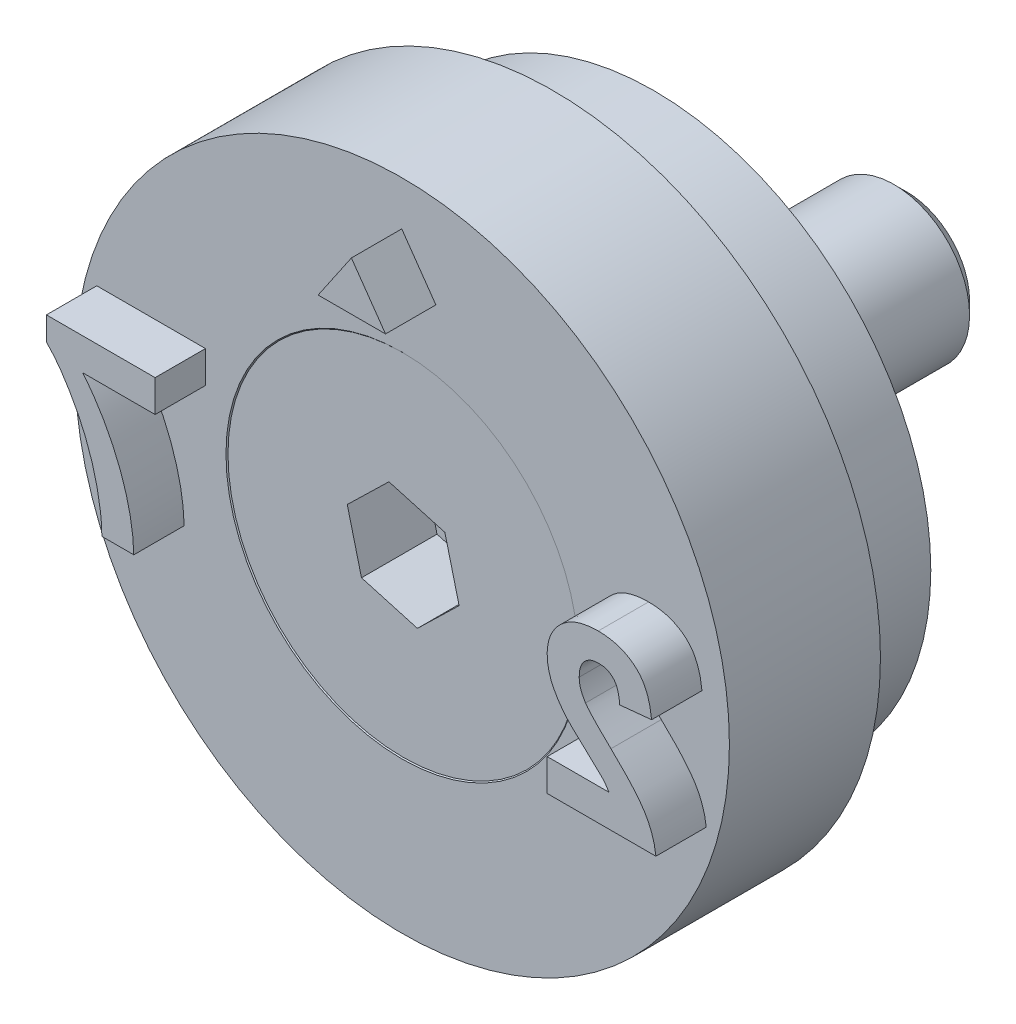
ISO-10303-21;
HEADER;
FILE_DESCRIPTION(('STEP AP214'),'2;1');
FILE_NAME('part.step','',(''),(''),'','','');
FILE_SCHEMA(('AUTOMOTIVE_DESIGN { 1 0 10303 214 1 1 1 1 }'));
ENDSEC;
DATA;
#1=APPLICATION_CONTEXT('core data for automotive mechanical design processes');
#2=APPLICATION_PROTOCOL_DEFINITION('international standard','automotive_design',2000,#1);
#3=PRODUCT_CONTEXT('',#1,'mechanical');
#4=PRODUCT('Part','Part','',(#3));
#5=PRODUCT_RELATED_PRODUCT_CATEGORY('part','',(#4));
#6=PRODUCT_DEFINITION_FORMATION('','',#4);
#7=PRODUCT_DEFINITION_CONTEXT('part definition',#1,'design');
#8=PRODUCT_DEFINITION('design','',#6,#7);
#9=PRODUCT_DEFINITION_SHAPE('','',#8);
#10=(LENGTH_UNIT() NAMED_UNIT(*) SI_UNIT(.MILLI.,.METRE.));
#11=(NAMED_UNIT(*) PLANE_ANGLE_UNIT() SI_UNIT($,.RADIAN.));
#12=(NAMED_UNIT(*) SI_UNIT($,.STERADIAN.) SOLID_ANGLE_UNIT());
#13=UNCERTAINTY_MEASURE_WITH_UNIT(LENGTH_MEASURE(1.E-05),#10,'distance_accuracy_value','');
#14=(GEOMETRIC_REPRESENTATION_CONTEXT(3) GLOBAL_UNCERTAINTY_ASSIGNED_CONTEXT((#13)) GLOBAL_UNIT_ASSIGNED_CONTEXT((#10,
#11,#12)) REPRESENTATION_CONTEXT('',''));
#15=CARTESIAN_POINT('',(0.,0.,0.));
#16=DIRECTION('',(0.,0.,1.));
#17=DIRECTION('',(1.,0.,0.));
#18=AXIS2_PLACEMENT_3D('',#15,#16,#17);
#19=CARTESIAN_POINT('',(0.,0.,-0.0200000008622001));
#20=DIRECTION('',(0.,0.,1.));
#21=DIRECTION('',(1.,0.,0.));
#22=AXIS2_PLACEMENT_3D('',#19,#20,#21);
#23=CYLINDRICAL_SURFACE('',#22,1.5);
#24=CARTESIAN_POINT('',(0.,0.,-2.0000000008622));
#25=DIRECTION('',(0.,0.,1.));
#26=DIRECTION('',(1.,0.,0.));
#27=AXIS2_PLACEMENT_3D('',#24,#25,#26);
#28=CIRCLE('',#27,1.5);
#29=CARTESIAN_POINT('',(1.5,0.,-2.0000000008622));
#30=VERTEX_POINT('',#29);
#31=EDGE_CURVE('E12',#30,#30,#28,.T.);
#32=ORIENTED_EDGE('',*,*,#31,.F.);
#33=EDGE_LOOP('',(#32));
#34=FACE_BOUND('',#33,.T.);
#35=CARTESIAN_POINT('',(0.,0.,-9.7700000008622));
#36=DIRECTION('',(0.,0.,1.));
#37=DIRECTION('',(1.,0.,0.));
#38=AXIS2_PLACEMENT_3D('',#35,#36,#37);
#39=CIRCLE('',#38,1.5);
#40=CARTESIAN_POINT('',(1.5,0.,-9.7700000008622));
#41=VERTEX_POINT('',#40);
#42=EDGE_CURVE('E150',#41,#41,#39,.T.);
#43=ORIENTED_EDGE('',*,*,#42,.T.);
#44=EDGE_LOOP('',(#43));
#45=FACE_BOUND('',#44,.T.);
#46=ADVANCED_FACE('F49',(#34,#45),#23,.T.);
#47=CARTESIAN_POINT('',(0.,0.,-2.0000000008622));
#48=DIRECTION('',(0.,0.,1.));
#49=DIRECTION('',(1.,0.,0.));
#50=AXIS2_PLACEMENT_3D('',#47,#48,#49);
#51=CONICAL_SURFACE('',#50,1.5,0.785398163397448);
#52=CARTESIAN_POINT('',(0.,0.,-0.0200000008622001));
#53=DIRECTION('',(0.,0.,1.));
#54=DIRECTION('',(1.,0.,0.));
#55=AXIS2_PLACEMENT_3D('',#52,#53,#54);
#56=CIRCLE('',#55,3.48);
#57=CARTESIAN_POINT('',(3.48,0.,-0.0200000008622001));
#58=VERTEX_POINT('',#57);
#59=EDGE_CURVE('E56',#58,#58,#56,.T.);
#60=ORIENTED_EDGE('',*,*,#59,.F.);
#61=EDGE_LOOP('',(#60));
#62=FACE_BOUND('',#61,.T.);
#63=ORIENTED_EDGE('',*,*,#31,.T.);
#64=EDGE_LOOP('',(#63));
#65=FACE_BOUND('',#64,.T.);
#66=ADVANCED_FACE('F165',(#62,#65),#51,.T.);
#67=CARTESIAN_POINT('',(0.,3.48,-0.0200000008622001));
#68=DIRECTION('',(0.,0.,-1.));
#69=DIRECTION('',(-1.,0.,0.));
#70=AXIS2_PLACEMENT_3D('',#67,#68,#69);
#71=PLANE('',#70);
#72=DIRECTION('',(0.962144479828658,-0.272539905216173,0.));
#73=VECTOR('',#72,1.);
#74=CARTESIAN_POINT('',(-0.828034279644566,-0.804793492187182,-0.0200000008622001));
#75=LINE('',#74,#73);
#76=CARTESIAN_POINT('',(-0.828034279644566,-0.804793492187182,-0.0200000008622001));
#77=VERTEX_POINT('',#76);
#78=CARTESIAN_POINT('',(0.282954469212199,-1.11949546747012,-0.0200000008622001));
#79=VERTEX_POINT('',#78);
#80=EDGE_CURVE('E137',#77,#79,#75,.T.);
#81=ORIENTED_EDGE('',*,*,#80,.F.);
#82=DIRECTION('',(0.245045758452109,-0.969511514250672,0.));
#83=VECTOR('',#82,1.);
#84=CARTESIAN_POINT('',(-1.11098874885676,0.314701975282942,-0.0200000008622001));
#85=LINE('',#84,#83);
#86=CARTESIAN_POINT('',(-1.11098874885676,0.314701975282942,-0.0200000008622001));
#87=VERTEX_POINT('',#86);
#88=EDGE_CURVE('E63',#87,#77,#85,.T.);
#89=ORIENTED_EDGE('',*,*,#88,.F.);
#90=DIRECTION('',(-0.717098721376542,-0.696971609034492,0.));
#91=VECTOR('',#90,1.);
#92=CARTESIAN_POINT('',(-0.282954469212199,1.11949546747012,-0.0200000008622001));
#93=LINE('',#92,#91);
#94=CARTESIAN_POINT('',(-0.282954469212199,1.11949546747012,-0.0200000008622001));
#95=VERTEX_POINT('',#94);
#96=EDGE_CURVE('E146',#95,#87,#93,.T.);
#97=ORIENTED_EDGE('',*,*,#96,.F.);
#98=DIRECTION('',(-0.962144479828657,0.272539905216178,0.));
#99=VECTOR('',#98,1.);
#100=CARTESIAN_POINT('',(0.828034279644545,0.804793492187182,-0.0200000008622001));
#101=LINE('',#100,#99);
#102=CARTESIAN_POINT('',(0.828034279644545,0.804793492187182,-0.0200000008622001));
#103=VERTEX_POINT('',#102);
#104=EDGE_CURVE('E144',#103,#95,#101,.T.);
#105=ORIENTED_EDGE('',*,*,#104,.F.);
#106=DIRECTION('',(-0.245045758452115,0.96951151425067,0.));
#107=VECTOR('',#106,1.);
#108=CARTESIAN_POINT('',(1.11098874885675,-0.314701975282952,-0.0200000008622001));
#109=LINE('',#108,#107);
#110=CARTESIAN_POINT('',(1.11098874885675,-0.314701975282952,-0.0200000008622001));
#111=VERTEX_POINT('',#110);
#112=EDGE_CURVE('E111',#111,#103,#109,.T.);
#113=ORIENTED_EDGE('',*,*,#112,.F.);
#114=DIRECTION('',(0.717098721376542,0.696971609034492,0.));
#115=VECTOR('',#114,1.);
#116=CARTESIAN_POINT('',(0.282954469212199,-1.11949546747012,-0.0200000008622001));
#117=LINE('',#116,#115);
#118=EDGE_CURVE('E140',#79,#111,#117,.T.);
#119=ORIENTED_EDGE('',*,*,#118,.F.);
#120=EDGE_LOOP('',(#81,#89,#97,#105,#113,#119));
#121=FACE_BOUND('',#120,.T.);
#122=ORIENTED_EDGE('',*,*,#59,.T.);
#123=EDGE_LOOP('',(#122));
#124=FACE_BOUND('',#123,.T.);
#125=ADVANCED_FACE('F163',(#121,#124),#71,.F.);
#126=CARTESIAN_POINT('',(0.,0.,-10.0200000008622));
#127=DIRECTION('',(0.,0.,1.));
#128=DIRECTION('',(1.,0.,0.));
#129=AXIS2_PLACEMENT_3D('',#126,#127,#128);
#130=PLANE('',#129);
#131=CARTESIAN_POINT('',(0.,0.,-10.0200000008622));
#132=DIRECTION('',(0.,0.,1.));
#133=DIRECTION('',(1.,0.,0.));
#134=AXIS2_PLACEMENT_3D('',#131,#132,#133);
#135=CIRCLE('',#134,1.25);
#136=CARTESIAN_POINT('',(1.25,0.,-10.0200000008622));
#137=VERTEX_POINT('',#136);
#138=EDGE_CURVE('E158',#137,#137,#135,.T.);
#139=ORIENTED_EDGE('',*,*,#138,.F.);
#140=EDGE_LOOP('',(#139));
#141=FACE_BOUND('',#140,.T.);
#142=ADVANCED_FACE('F178',(#141),#130,.F.);
#143=CARTESIAN_POINT('',(0.,0.,-10.0200000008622));
#144=DIRECTION('',(0.,0.,1.));
#145=DIRECTION('',(1.,0.,0.));
#146=AXIS2_PLACEMENT_3D('',#143,#144,#145);
#147=CONICAL_SURFACE('',#146,1.25,0.78539816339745);
#148=ORIENTED_EDGE('',*,*,#42,.F.);
#149=EDGE_LOOP('',(#148));
#150=FACE_BOUND('',#149,.T.);
#151=ORIENTED_EDGE('',*,*,#138,.T.);
#152=EDGE_LOOP('',(#151));
#153=FACE_BOUND('',#152,.T.);
#154=ADVANCED_FACE('F174',(#150,#153),#147,.T.);
#155=CARTESIAN_POINT('',(-1.11098874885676,0.314701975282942,-1.5200000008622));
#156=DIRECTION('',(-0.969511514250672,-0.245045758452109,0.));
#157=DIRECTION('',(0.245045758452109,-0.969511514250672,0.));
#158=AXIS2_PLACEMENT_3D('',#155,#156,#157);
#159=PLANE('',#158);
#160=ORIENTED_EDGE('',*,*,#88,.T.);
#161=DIRECTION('',(0.,0.,1.));
#162=VECTOR('',#161,1.);
#163=CARTESIAN_POINT('',(-0.828034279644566,-0.804793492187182,-1.5200000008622));
#164=LINE('',#163,#162);
#165=CARTESIAN_POINT('',(-0.828034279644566,-0.804793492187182,-1.5200000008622));
#166=VERTEX_POINT('',#165);
#167=EDGE_CURVE('E93',#166,#77,#164,.T.);
#168=ORIENTED_EDGE('',*,*,#167,.F.);
#169=DIRECTION('',(0.245045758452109,-0.969511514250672,0.));
#170=VECTOR('',#169,1.);
#171=CARTESIAN_POINT('',(-1.11098874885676,0.314701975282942,-1.5200000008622));
#172=LINE('',#171,#170);
#173=CARTESIAN_POINT('',(-1.11098874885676,0.314701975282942,-1.5200000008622));
#174=VERTEX_POINT('',#173);
#175=EDGE_CURVE('E148',#174,#166,#172,.T.);
#176=ORIENTED_EDGE('',*,*,#175,.F.);
#177=DIRECTION('',(0.,0.,1.));
#178=VECTOR('',#177,1.);
#179=CARTESIAN_POINT('',(-1.11098874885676,0.314701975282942,-1.5200000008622));
#180=LINE('',#179,#178);
#181=EDGE_CURVE('E71',#174,#87,#180,.T.);
#182=ORIENTED_EDGE('',*,*,#181,.T.);
#183=EDGE_LOOP('',(#160,#168,#176,#182));
#184=FACE_BOUND('',#183,.T.);
#185=ADVANCED_FACE('F177',(#184),#159,.F.);
#186=CARTESIAN_POINT('',(-0.282954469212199,1.11949546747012,-1.5200000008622));
#187=DIRECTION('',(-0.696971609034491,0.717098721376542,0.));
#188=DIRECTION('',(-0.717098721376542,-0.696971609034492,0.));
#189=AXIS2_PLACEMENT_3D('',#186,#187,#188);
#190=PLANE('',#189);
#191=ORIENTED_EDGE('',*,*,#96,.T.);
#192=ORIENTED_EDGE('',*,*,#181,.F.);
#193=DIRECTION('',(-0.717098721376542,-0.696971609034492,0.));
#194=VECTOR('',#193,1.);
#195=CARTESIAN_POINT('',(-0.282954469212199,1.11949546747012,-1.5200000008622));
#196=LINE('',#195,#194);
#197=CARTESIAN_POINT('',(-0.282954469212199,1.11949546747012,-1.5200000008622));
#198=VERTEX_POINT('',#197);
#199=EDGE_CURVE('E123',#198,#174,#196,.T.);
#200=ORIENTED_EDGE('',*,*,#199,.F.);
#201=DIRECTION('',(0.,0.,1.));
#202=VECTOR('',#201,1.);
#203=CARTESIAN_POINT('',(-0.282954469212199,1.11949546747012,-1.5200000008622));
#204=LINE('',#203,#202);
#205=EDGE_CURVE('E115',#198,#95,#204,.T.);
#206=ORIENTED_EDGE('',*,*,#205,.T.);
#207=EDGE_LOOP('',(#191,#192,#200,#206));
#208=FACE_BOUND('',#207,.T.);
#209=ADVANCED_FACE('F192',(#208),#190,.F.);
#210=CARTESIAN_POINT('',(0.828034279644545,0.804793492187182,-1.5200000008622));
#211=DIRECTION('',(0.272539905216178,0.962144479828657,0.));
#212=DIRECTION('',(-0.962144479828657,0.272539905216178,0.));
#213=AXIS2_PLACEMENT_3D('',#210,#211,#212);
#214=PLANE('',#213);
#215=ORIENTED_EDGE('',*,*,#104,.T.);
#216=ORIENTED_EDGE('',*,*,#205,.F.);
#217=DIRECTION('',(-0.962144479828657,0.272539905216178,0.));
#218=VECTOR('',#217,1.);
#219=CARTESIAN_POINT('',(0.828034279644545,0.804793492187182,-1.5200000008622));
#220=LINE('',#219,#218);
#221=CARTESIAN_POINT('',(0.828034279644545,0.804793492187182,-1.5200000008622));
#222=VERTEX_POINT('',#221);
#223=EDGE_CURVE('E119',#222,#198,#220,.T.);
#224=ORIENTED_EDGE('',*,*,#223,.F.);
#225=DIRECTION('',(0.,0.,1.));
#226=VECTOR('',#225,1.);
#227=CARTESIAN_POINT('',(0.828034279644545,0.804793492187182,-1.5200000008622));
#228=LINE('',#227,#226);
#229=EDGE_CURVE('E104',#222,#103,#228,.T.);
#230=ORIENTED_EDGE('',*,*,#229,.T.);
#231=EDGE_LOOP('',(#215,#216,#224,#230));
#232=FACE_BOUND('',#231,.T.);
#233=ADVANCED_FACE('F120',(#232),#214,.F.);
#234=CARTESIAN_POINT('',(1.11098874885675,-0.314701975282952,-1.5200000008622));
#235=DIRECTION('',(0.96951151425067,0.245045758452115,0.));
#236=DIRECTION('',(-0.245045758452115,0.96951151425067,0.));
#237=AXIS2_PLACEMENT_3D('',#234,#235,#236);
#238=PLANE('',#237);
#239=ORIENTED_EDGE('',*,*,#112,.T.);
#240=ORIENTED_EDGE('',*,*,#229,.F.);
#241=DIRECTION('',(-0.245045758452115,0.96951151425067,0.));
#242=VECTOR('',#241,1.);
#243=CARTESIAN_POINT('',(1.11098874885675,-0.314701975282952,-1.5200000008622));
#244=LINE('',#243,#242);
#245=CARTESIAN_POINT('',(1.11098874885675,-0.314701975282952,-1.5200000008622));
#246=VERTEX_POINT('',#245);
#247=EDGE_CURVE('E108',#246,#222,#244,.T.);
#248=ORIENTED_EDGE('',*,*,#247,.F.);
#249=DIRECTION('',(0.,0.,1.));
#250=VECTOR('',#249,1.);
#251=CARTESIAN_POINT('',(1.11098874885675,-0.314701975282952,-1.5200000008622));
#252=LINE('',#251,#250);
#253=EDGE_CURVE('E116',#246,#111,#252,.T.);
#254=ORIENTED_EDGE('',*,*,#253,.T.);
#255=EDGE_LOOP('',(#239,#240,#248,#254));
#256=FACE_BOUND('',#255,.T.);
#257=ADVANCED_FACE('F106',(#256),#238,.F.);
#258=CARTESIAN_POINT('',(0.282954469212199,-1.11949546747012,-1.5200000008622));
#259=DIRECTION('',(0.696971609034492,-0.717098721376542,0.));
#260=DIRECTION('',(0.717098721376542,0.696971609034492,0.));
#261=AXIS2_PLACEMENT_3D('',#258,#259,#260);
#262=PLANE('',#261);
#263=ORIENTED_EDGE('',*,*,#118,.T.);
#264=ORIENTED_EDGE('',*,*,#253,.F.);
#265=DIRECTION('',(0.717098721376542,0.696971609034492,0.));
#266=VECTOR('',#265,1.);
#267=CARTESIAN_POINT('',(0.282954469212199,-1.11949546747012,-1.5200000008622));
#268=LINE('',#267,#266);
#269=CARTESIAN_POINT('',(0.282954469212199,-1.11949546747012,-1.5200000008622));
#270=VERTEX_POINT('',#269);
#271=EDGE_CURVE('E129',#270,#246,#268,.T.);
#272=ORIENTED_EDGE('',*,*,#271,.F.);
#273=DIRECTION('',(0.,0.,1.));
#274=VECTOR('',#273,1.);
#275=CARTESIAN_POINT('',(0.282954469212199,-1.11949546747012,-1.5200000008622));
#276=LINE('',#275,#274);
#277=EDGE_CURVE('E153',#270,#79,#276,.T.);
#278=ORIENTED_EDGE('',*,*,#277,.T.);
#279=EDGE_LOOP('',(#263,#264,#272,#278));
#280=FACE_BOUND('',#279,.T.);
#281=ADVANCED_FACE('F196',(#280),#262,.F.);
#282=CARTESIAN_POINT('',(-0.828034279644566,-0.804793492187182,-1.5200000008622));
#283=DIRECTION('',(-0.272539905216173,-0.962144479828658,0.));
#284=DIRECTION('',(0.962144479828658,-0.272539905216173,0.));
#285=AXIS2_PLACEMENT_3D('',#282,#283,#284);
#286=PLANE('',#285);
#287=ORIENTED_EDGE('',*,*,#80,.T.);
#288=ORIENTED_EDGE('',*,*,#277,.F.);
#289=DIRECTION('',(0.962144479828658,-0.272539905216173,0.));
#290=VECTOR('',#289,1.);
#291=CARTESIAN_POINT('',(-0.828034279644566,-0.804793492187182,-1.5200000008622));
#292=LINE('',#291,#290);
#293=EDGE_CURVE('E131',#166,#270,#292,.T.);
#294=ORIENTED_EDGE('',*,*,#293,.F.);
#295=ORIENTED_EDGE('',*,*,#167,.T.);
#296=EDGE_LOOP('',(#287,#288,#294,#295));
#297=FACE_BOUND('',#296,.T.);
#298=ADVANCED_FACE('F193',(#297),#286,.F.);
#299=CARTESIAN_POINT('',(0.,0.,-1.5200000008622));
#300=DIRECTION('',(0.,0.,1.));
#301=DIRECTION('',(1.,0.,0.));
#302=AXIS2_PLACEMENT_3D('',#299,#300,#301);
#303=PLANE('',#302);
#304=ORIENTED_EDGE('',*,*,#175,.T.);
#305=ORIENTED_EDGE('',*,*,#293,.T.);
#306=ORIENTED_EDGE('',*,*,#271,.T.);
#307=ORIENTED_EDGE('',*,*,#247,.T.);
#308=ORIENTED_EDGE('',*,*,#223,.T.);
#309=ORIENTED_EDGE('',*,*,#199,.T.);
#310=EDGE_LOOP('',(#304,#305,#306,#307,#308,#309));
#311=FACE_BOUND('',#310,.T.);
#312=ADVANCED_FACE('F126',(#311),#303,.T.);
#313=CLOSED_SHELL('',(#46,#66,#125,#142,#154,#185,#209,#233,#257,#281,#298,#312));
#314=MANIFOLD_SOLID_BREP('B2',#313);
#315=CARTESIAN_POINT('',(0.,6.5,0.));
#316=DIRECTION('',(0.,0.,-1.));
#317=DIRECTION('',(-1.,0.,0.));
#318=AXIS2_PLACEMENT_3D('',#315,#316,#317);
#319=PLANE('',#318);
#320=DIRECTION('',(1.,0.,0.));
#321=VECTOR('',#320,1.);
#322=CARTESIAN_POINT('',(-5.34713862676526,0.973666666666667,0.));
#323=LINE('',#322,#321);
#324=CARTESIAN_POINT('',(-5.34713862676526,0.973666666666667,0.));
#325=VERTEX_POINT('',#324);
#326=CARTESIAN_POINT('',(-3.90714383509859,0.973666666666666,0.));
#327=VERTEX_POINT('',#326);
#328=EDGE_CURVE('E482',#325,#327,#323,.T.);
#329=ORIENTED_EDGE('',*,*,#328,.F.);
#330=CARTESIAN_POINT('',(-4.33047716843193,-1.651,0.));
#331=CARTESIAN_POINT('',(-4.33260046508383,-1.59474645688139,0.));
#332=CARTESIAN_POINT('',(-4.33687064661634,-1.4816144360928,0.));
#333=CARTESIAN_POINT('',(-4.35284731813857,-1.31180696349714,0.));
#334=CARTESIAN_POINT('',(-4.37794039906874,-1.14136720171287,0.));
#335=CARTESIAN_POINT('',(-4.40910768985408,-0.969901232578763,0.));
#336=CARTESIAN_POINT('',(-4.45025628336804,-0.797826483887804,0.));
#337=CARTESIAN_POINT('',(-4.49721943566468,-0.624505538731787,0.));
#338=CARTESIAN_POINT('',(-4.55410823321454,-0.450864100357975,0.));
#339=CARTESIAN_POINT('',(-4.6178790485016,-0.277234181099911,0.));
#340=CARTESIAN_POINT('',(-4.68827867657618,-0.105264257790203,0.));
#341=CARTESIAN_POINT('',(-4.76500436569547,0.0629126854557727,0.));
#342=CARTESIAN_POINT('',(-4.84785777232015,0.226247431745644,0.));
#343=CARTESIAN_POINT('',(-4.93576140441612,0.385313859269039,0.));
#344=CARTESIAN_POINT('',(-5.02973789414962,0.539600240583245,0.));
#345=CARTESIAN_POINT('',(-5.12985799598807,0.688939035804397,0.));
#346=CARTESIAN_POINT('',(-5.23470153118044,0.83441051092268,0.));
#347=CARTESIAN_POINT('',(-5.30966590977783,0.927255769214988,0.));
#348=CARTESIAN_POINT('',(-5.34713862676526,0.973666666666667,0.));
#349=B_SPLINE_CURVE_WITH_KNOTS('',3,(#330,#331,#332,#333,#334,#335,#336,#337,#338,#339,#340,
#341,#342,#343,#344,#345,#346,#347,#348),.UNSPECIFIED.,.F.,.F.,(4,1,1,1,1,1,1,1,1,1,1,1,1,1,1,1,
4),(0.,0.0589531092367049,0.118561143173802,0.178522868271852,0.239353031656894,
0.301026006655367,0.363773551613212,0.427382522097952,0.492333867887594,0.557475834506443,
0.621960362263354,0.685889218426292,0.749254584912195,0.812267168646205,0.875035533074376,
0.937533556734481,1.),.UNSPECIFIED.);
#350=CARTESIAN_POINT('',(-4.33047716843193,-1.651,0.));
#351=VERTEX_POINT('',#350);
#352=EDGE_CURVE('E495',#351,#325,#349,.T.);
#353=ORIENTED_EDGE('',*,*,#352,.F.);
#354=DIRECTION('',(1.,0.,0.));
#355=VECTOR('',#354,1.);
#356=CARTESIAN_POINT('',(-4.96547716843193,-1.651,0.));
#357=LINE('',#356,#355);
#358=CARTESIAN_POINT('',(-4.96547716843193,-1.651,0.));
#359=VERTEX_POINT('',#358);
#360=EDGE_CURVE('E752',#359,#351,#357,.T.);
#361=ORIENTED_EDGE('',*,*,#360,.F.);
#362=CARTESIAN_POINT('',(-6.06614383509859,1.143,0.));
#363=CARTESIAN_POINT('',(-6.04362139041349,1.12008414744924,0.));
#364=CARTESIAN_POINT('',(-5.99732171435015,1.07297573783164,0.));
#365=CARTESIAN_POINT('',(-5.93100195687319,0.995878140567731,0.));
#366=CARTESIAN_POINT('',(-5.86369958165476,0.91221371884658,0.));
#367=CARTESIAN_POINT('',(-5.79682194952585,0.820855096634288,0.));
#368=CARTESIAN_POINT('',(-5.72829020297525,0.723245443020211,0.));
#369=CARTESIAN_POINT('',(-5.66111607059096,0.61751364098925,0.));
#370=CARTESIAN_POINT('',(-5.59298647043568,0.505031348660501,0.));
#371=CARTESIAN_POINT('',(-5.50126248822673,0.345924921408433,0.));
#372=CARTESIAN_POINT('',(-5.39404859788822,0.138082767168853,0.));
#373=CARTESIAN_POINT('',(-5.28062197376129,-0.120275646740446,0.));
#374=CARTESIAN_POINT('',(-5.18398768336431,-0.386568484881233,0.));
#375=CARTESIAN_POINT('',(-5.1178167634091,-0.613469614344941,0.));
#376=CARTESIAN_POINT('',(-5.07310765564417,-0.795330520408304,0.));
#377=CARTESIAN_POINT('',(-5.04389688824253,-0.928311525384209,0.));
#378=CARTESIAN_POINT('',(-5.0193076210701,-1.05755027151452,0.));
#379=CARTESIAN_POINT('',(-4.9993042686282,-1.18327389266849,0.));
#380=CARTESIAN_POINT('',(-4.98437520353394,-1.30553974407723,0.));
#381=CARTESIAN_POINT('',(-4.97257869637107,-1.42392274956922,0.));
#382=CARTESIAN_POINT('',(-4.96675879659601,-1.53871158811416,0.));
#383=CARTESIAN_POINT('',(-4.96590000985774,-1.61395322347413,0.));
#384=CARTESIAN_POINT('',(-4.96547716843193,-1.651,0.));
#385=B_SPLINE_CURVE_WITH_KNOTS('',3,(#362,#363,#364,#365,#366,#367,#368,#369,#370,#371,#372,
#373,#374,#375,#376,#377,#378,#379,#380,#381,#382,#383,#384),.UNSPECIFIED.,.F.,.F.,(4,1,1,1,1,1,
1,1,1,1,1,1,1,1,1,1,1,1,1,1,4),(0.,0.031427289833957,0.0646054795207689,0.0994393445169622,
0.136456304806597,0.175351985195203,0.216100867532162,0.258977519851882,0.304007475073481,
0.395756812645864,0.487615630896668,0.579873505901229,0.672707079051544,0.718694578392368,
0.76307923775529,0.80589344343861,0.847386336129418,0.88760014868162,0.926386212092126,
0.963754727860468,1.),.UNSPECIFIED.);
#386=CARTESIAN_POINT('',(-6.06614383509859,1.143,0.));
#387=VERTEX_POINT('',#386);
#388=EDGE_CURVE('E747',#387,#359,#385,.T.);
#389=ORIENTED_EDGE('',*,*,#388,.F.);
#390=DIRECTION('',(0.,-1.,0.));
#391=VECTOR('',#390,1.);
#392=CARTESIAN_POINT('',(-6.06614383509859,1.60866666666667,0.));
#393=LINE('',#392,#391);
#394=CARTESIAN_POINT('',(-6.06614383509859,1.60866666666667,0.));
#395=VERTEX_POINT('',#394);
#396=EDGE_CURVE('E744',#395,#387,#393,.T.);
#397=ORIENTED_EDGE('',*,*,#396,.F.);
#398=DIRECTION('',(-1.,0.,0.));
#399=VECTOR('',#398,1.);
#400=CARTESIAN_POINT('',(-3.90714383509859,1.60866666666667,0.));
#401=LINE('',#400,#399);
#402=CARTESIAN_POINT('',(-3.90714383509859,1.60866666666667,0.));
#403=VERTEX_POINT('',#402);
#404=EDGE_CURVE('E741',#403,#395,#401,.T.);
#405=ORIENTED_EDGE('',*,*,#404,.F.);
#406=DIRECTION('',(0.,1.,0.));
#407=VECTOR('',#406,1.);
#408=CARTESIAN_POINT('',(-3.90714383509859,0.973666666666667,0.));
#409=LINE('',#408,#407);
#410=EDGE_CURVE('E485',#327,#403,#409,.T.);
#411=ORIENTED_EDGE('',*,*,#410,.F.);
#412=EDGE_LOOP('',(#329,#353,#361,#389,#397,#405,#411));
#413=FACE_BOUND('',#412,.T.);
#414=CARTESIAN_POINT('',(0.,0.,0.));
#415=DIRECTION('',(0.,0.,1.));
#416=DIRECTION('',(1.,0.,0.));
#417=AXIS2_PLACEMENT_3D('',#414,#415,#416);
#418=CIRCLE('',#417,6.5);
#419=CARTESIAN_POINT('',(6.5,0.,0.));
#420=VERTEX_POINT('',#419);
#421=EDGE_CURVE('E47',#420,#420,#418,.T.);
#422=ORIENTED_EDGE('',*,*,#421,.T.);
#423=EDGE_LOOP('',(#422));
#424=FACE_BOUND('',#423,.T.);
#425=CARTESIAN_POINT('',(0.,0.,0.));
#426=DIRECTION('',(0.,0.,1.));
#427=DIRECTION('',(1.,0.,0.));
#428=AXIS2_PLACEMENT_3D('',#425,#426,#427);
#429=CIRCLE('',#428,3.5000000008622);
#430=CARTESIAN_POINT('',(3.5000000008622,0.,0.));
#431=VERTEX_POINT('',#430);
#432=EDGE_CURVE('E317',#431,#431,#429,.T.);
#433=ORIENTED_EDGE('',*,*,#432,.F.);
#434=EDGE_LOOP('',(#433));
#435=FACE_BOUND('',#434,.T.);
#436=DIRECTION('',(-1.,0.,0.));
#437=VECTOR('',#436,1.);
#438=CARTESIAN_POINT('',(5.10750137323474,-1.016,0.));
#439=LINE('',#438,#437);
#440=CARTESIAN_POINT('',(5.10750137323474,-1.016,0.));
#441=VERTEX_POINT('',#440);
#442=CARTESIAN_POINT('',(3.88049616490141,-1.016,0.));
#443=VERTEX_POINT('',#442);
#444=EDGE_CURVE('E558',#441,#443,#439,.T.);
#445=ORIENTED_EDGE('',*,*,#444,.F.);
#446=CARTESIAN_POINT('',(4.20064199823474,-0.07540625,0.));
#447=CARTESIAN_POINT('',(4.21068533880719,-0.0880558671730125,0.));
#448=CARTESIAN_POINT('',(4.23219584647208,-0.115148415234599,0.));
#449=CARTESIAN_POINT('',(4.26879087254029,-0.156690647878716,0.));
#450=CARTESIAN_POINT('',(4.31120136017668,-0.202067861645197,0.));
#451=CARTESIAN_POINT('',(4.35882827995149,-0.252129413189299,0.));
#452=CARTESIAN_POINT('',(4.4132448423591,-0.305102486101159,0.));
#453=CARTESIAN_POINT('',(4.47249313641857,-0.363202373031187,0.));
#454=CARTESIAN_POINT('',(4.53918025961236,-0.423457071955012,0.));
#455=CARTESIAN_POINT('',(4.60825195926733,-0.487369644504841,0.));
#456=CARTESIAN_POINT('',(4.67762389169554,-0.549574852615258,0.));
#457=CARTESIAN_POINT('',(4.7413866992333,-0.608656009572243,0.));
#458=CARTESIAN_POINT('',(4.79930454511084,-0.660930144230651,0.));
#459=CARTESIAN_POINT('',(4.84868008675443,-0.709283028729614,0.));
#460=CARTESIAN_POINT('',(4.89241758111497,-0.750414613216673,0.));
#461=CARTESIAN_POINT('',(4.92894058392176,-0.786434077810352,0.));
#462=CARTESIAN_POINT('',(4.95893252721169,-0.816469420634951,0.));
#463=CARTESIAN_POINT('',(5.00025949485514,-0.863286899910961,0.));
#464=CARTESIAN_POINT('',(5.05284337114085,-0.926607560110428,0.));
#465=CARTESIAN_POINT('',(5.08983827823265,-0.987112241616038,0.));
#466=CARTESIAN_POINT('',(5.10750137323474,-1.016,0.));
#467=B_SPLINE_CURVE_WITH_KNOTS('',3,(#446,#447,#448,#449,#450,#451,#452,#453,#454,#455,#456,
#457,#458,#459,#460,#461,#462,#463,#464,#465,#466),.UNSPECIFIED.,.F.,.F.,(4,1,1,1,1,1,1,1,1,1,1,
1,1,1,1,1,1,1,4),(0.,0.0369753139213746,0.0791925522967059,0.126700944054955,0.179184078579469,
0.23736864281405,0.300558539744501,0.369153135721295,0.443112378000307,0.516018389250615,
0.582473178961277,0.642136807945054,0.694619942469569,0.740679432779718,0.779589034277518,
0.812073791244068,0.837814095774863,0.922564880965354,1.),.UNSPECIFIED.);
#468=CARTESIAN_POINT('',(4.20064199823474,-0.07540625,0.));
#469=VERTEX_POINT('',#468);
#470=EDGE_CURVE('E635',#469,#441,#467,.T.);
#471=ORIENTED_EDGE('',*,*,#470,.F.);
#472=CARTESIAN_POINT('',(3.88049616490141,0.752739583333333,0.));
#473=CARTESIAN_POINT('',(3.88130403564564,0.716746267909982,0.));
#474=CARTESIAN_POINT('',(3.88290672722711,0.64534105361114,0.));
#475=CARTESIAN_POINT('',(3.89825131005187,0.539782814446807,0.));
#476=CARTESIAN_POINT('',(3.92169484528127,0.436658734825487,0.));
#477=CARTESIAN_POINT('',(3.95634254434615,0.335716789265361,0.));
#478=CARTESIAN_POINT('',(4.00026119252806,0.234535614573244,0.));
#479=CARTESIAN_POINT('',(4.05687338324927,0.13288810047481,0.));
#480=CARTESIAN_POINT('',(4.1226044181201,0.027708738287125,0.));
#481=CARTESIAN_POINT('',(4.17406922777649,-0.0402943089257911,0.));
#482=CARTESIAN_POINT('',(4.20064199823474,-0.07540625,0.));
#483=B_SPLINE_CURVE_WITH_KNOTS('',3,(#472,#473,#474,#475,#476,#477,#478,#479,#480,#481,#482),
.UNSPECIFIED.,.F.,.F.,(4,1,1,1,1,1,1,1,4),(0.,0.119176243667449,0.236427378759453,
0.352663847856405,0.469086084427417,0.589462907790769,0.717601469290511,0.854189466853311,1.),.UNSPECIFIED.);
#484=CARTESIAN_POINT('',(3.88049616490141,0.752739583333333,0.));
#485=VERTEX_POINT('',#484);
#486=EDGE_CURVE('E627',#485,#469,#483,.T.);
#487=ORIENTED_EDGE('',*,*,#486,.F.);
#488=CARTESIAN_POINT('',(4.89385033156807,1.651,0.));
#489=CARTESIAN_POINT('',(4.85545734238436,1.65026210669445,0.));
#490=CARTESIAN_POINT('',(4.7806821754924,1.64882496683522,0.));
#491=CARTESIAN_POINT('',(4.67152370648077,1.63695705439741,0.));
#492=CARTESIAN_POINT('',(4.56897716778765,1.61626362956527,0.));
#493=CARTESIAN_POINT('',(4.47214602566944,1.58885225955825,0.));
#494=CARTESIAN_POINT('',(4.38202468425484,1.55225607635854,0.));
#495=CARTESIAN_POINT('',(4.29786216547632,1.50801281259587,0.));
#496=CARTESIAN_POINT('',(4.22098304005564,1.45444334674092,0.));
#497=CARTESIAN_POINT('',(4.15024132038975,1.39446904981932,0.));
#498=CARTESIAN_POINT('',(4.08700388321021,1.32851676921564,0.));
#499=CARTESIAN_POINT('',(4.03161361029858,1.25816751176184,0.));
#500=CARTESIAN_POINT('',(3.98520782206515,1.18347028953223,0.));
#501=CARTESIAN_POINT('',(3.94626623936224,1.10533557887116,0.));
#502=CARTESIAN_POINT('',(3.91735237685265,1.02250607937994,0.));
#503=CARTESIAN_POINT('',(3.89628447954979,0.936127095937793,0.));
#504=CARTESIAN_POINT('',(3.88231561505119,0.845795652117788,0.));
#505=CARTESIAN_POINT('',(3.8811093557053,0.784101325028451,0.));
#506=CARTESIAN_POINT('',(3.88049616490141,0.752739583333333,0.));
#507=B_SPLINE_CURVE_WITH_KNOTS('',3,(#488,#489,#490,#491,#492,#493,#494,#495,#496,#497,#498,
#499,#500,#501,#502,#503,#504,#505,#506),.UNSPECIFIED.,.F.,.F.,(4,1,1,1,1,1,1,1,1,1,1,1,1,1,1,1,
4),(0.,0.0756723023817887,0.147381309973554,0.216084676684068,0.281698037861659,
0.345459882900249,0.407485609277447,0.46873129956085,0.529782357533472,0.590032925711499,
0.648548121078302,0.70595351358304,0.763101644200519,0.820289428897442,0.878479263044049,
0.938226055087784,1.),.UNSPECIFIED.);
#508=CARTESIAN_POINT('',(4.89385033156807,1.651,0.));
#509=VERTEX_POINT('',#508);
#510=EDGE_CURVE('E619',#509,#485,#507,.T.);
#511=ORIENTED_EDGE('',*,*,#510,.F.);
#512=CARTESIAN_POINT('',(5.95482949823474,0.65484375,0.));
#513=CARTESIAN_POINT('',(5.94972419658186,0.697714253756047,0.));
#514=CARTESIAN_POINT('',(5.93982583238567,0.780833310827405,0.));
#515=CARTESIAN_POINT('',(5.91512429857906,0.900220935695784,0.));
#516=CARTESIAN_POINT('',(5.88384072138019,1.01036140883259,0.));
#517=CARTESIAN_POINT('',(5.84448370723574,1.11105032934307,0.));
#518=CARTESIAN_POINT('',(5.79867992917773,1.20292798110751,0.));
#519=CARTESIAN_POINT('',(5.74409301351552,1.28461568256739,0.));
#520=CARTESIAN_POINT('',(5.68263028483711,1.35701830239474,0.));
#521=CARTESIAN_POINT('',(5.61423862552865,1.42009730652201,0.));
#522=CARTESIAN_POINT('',(5.53935282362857,1.47405336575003,0.));
#523=CARTESIAN_POINT('',(5.46077361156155,1.52221742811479,0.));
#524=CARTESIAN_POINT('',(5.37696533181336,1.56172727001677,0.));
#525=CARTESIAN_POINT('',(5.28885071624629,1.59428931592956,0.));
#526=CARTESIAN_POINT('',(5.19646958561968,1.6203126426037,0.));
#527=CARTESIAN_POINT('',(5.0993946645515,1.63751891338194,0.));
#528=CARTESIAN_POINT('',(4.99822506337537,1.64962187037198,0.));
#529=CARTESIAN_POINT('',(4.92916627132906,1.65053369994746,0.));
#530=CARTESIAN_POINT('',(4.89385033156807,1.651,0.));
#531=B_SPLINE_CURVE_WITH_KNOTS('',3,(#512,#513,#514,#515,#516,#517,#518,#519,#520,#521,#522,
#523,#524,#525,#526,#527,#528,#529,#530),.UNSPECIFIED.,.F.,.F.,(4,1,1,1,1,1,1,1,1,1,1,1,1,1,1,1,
4),(0.,0.0794357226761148,0.154013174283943,0.224141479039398,0.289934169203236,
0.352732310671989,0.412725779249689,0.470302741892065,0.527168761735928,0.583502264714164,
0.639948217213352,0.696584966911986,0.753726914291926,0.812707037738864,0.872963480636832,
0.93503486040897,1.),.UNSPECIFIED.);
#532=CARTESIAN_POINT('',(5.95482949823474,0.65484375,0.));
#533=VERTEX_POINT('',#532);
#534=EDGE_CURVE('E614',#533,#509,#531,.T.);
#535=ORIENTED_EDGE('',*,*,#534,.F.);
#536=DIRECTION('',(0.995240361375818,0.0974506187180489,0.));
#537=VECTOR('',#536,1.);
#538=CARTESIAN_POINT('',(5.31982949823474,0.592666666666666,0.));
#539=LINE('',#538,#537);
#540=CARTESIAN_POINT('',(5.31982949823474,0.592666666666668,0.));
#541=VERTEX_POINT('',#540);
#542=EDGE_CURVE('E608',#541,#533,#539,.T.);
#543=ORIENTED_EDGE('',*,*,#542,.F.);
#544=CARTESIAN_POINT('',(4.90707949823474,1.10066666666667,0.));
#545=CARTESIAN_POINT('',(4.9358803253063,1.09936181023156,0.));
#546=CARTESIAN_POINT('',(4.99151730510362,1.09684110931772,0.));
#547=CARTESIAN_POINT('',(5.07058952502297,1.07482061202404,0.));
#548=CARTESIAN_POINT('',(5.1397631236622,1.0367008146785,0.));
#549=CARTESIAN_POINT('',(5.18905990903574,0.993259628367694,0.));
#550=CARTESIAN_POINT('',(5.22236222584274,0.951016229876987,0.));
#551=CARTESIAN_POINT('',(5.24505326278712,0.914203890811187,0.));
#552=CARTESIAN_POINT('',(5.26461116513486,0.872373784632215,0.));
#553=CARTESIAN_POINT('',(5.28194109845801,0.8259968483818,0.));
#554=CARTESIAN_POINT('',(5.29562978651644,0.774541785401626,0.));
#555=CARTESIAN_POINT('',(5.30665380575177,0.718400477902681,0.));
#556=CARTESIAN_POINT('',(5.31553757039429,0.657270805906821,0.));
#557=CARTESIAN_POINT('',(5.31836276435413,0.614744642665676,0.));
#558=CARTESIAN_POINT('',(5.31982949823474,0.592666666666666,0.));
#559=B_SPLINE_CURVE_WITH_KNOTS('',3,(#544,#545,#546,#547,#548,#549,#550,#551,#552,#553,#554,
#555,#556,#557,#558),.UNSPECIFIED.,.F.,.F.,(4,1,1,1,1,1,1,1,1,1,1,1,4),(0.,0.116899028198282,
0.225823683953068,0.330086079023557,0.43545148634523,0.490306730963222,0.548244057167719,
0.610766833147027,0.677675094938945,0.749188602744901,0.826858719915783,0.910111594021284,1.),.UNSPECIFIED.);
#560=CARTESIAN_POINT('',(4.90707949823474,1.10066666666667,0.));
#561=VERTEX_POINT('',#560);
#562=EDGE_CURVE('E600',#561,#541,#559,.T.);
#563=ORIENTED_EDGE('',*,*,#562,.F.);
#564=CARTESIAN_POINT('',(4.51549616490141,0.667411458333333,0.));
#565=CARTESIAN_POINT('',(4.51668543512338,0.700356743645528,0.));
#566=CARTESIAN_POINT('',(4.51893544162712,0.762686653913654,0.));
#567=CARTESIAN_POINT('',(4.53780213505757,0.850645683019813,0.));
#568=CARTESIAN_POINT('',(4.5712591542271,0.926258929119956,0.));
#569=CARTESIAN_POINT('',(4.61732331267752,0.989758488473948,0.));
#570=CARTESIAN_POINT('',(4.67557153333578,1.03951015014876,0.));
#571=CARTESIAN_POINT('',(4.7436653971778,1.07627179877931,0.));
#572=CARTESIAN_POINT('',(4.82260168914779,1.09659619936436,0.));
#573=CARTESIAN_POINT('',(4.87808277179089,1.09926949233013,0.));
#574=CARTESIAN_POINT('',(4.90707949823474,1.10066666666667,0.));
#575=B_SPLINE_CURVE_WITH_KNOTS('',3,(#564,#565,#566,#567,#568,#569,#570,#571,#572,#573,#574),
.UNSPECIFIED.,.F.,.F.,(4,1,1,1,1,1,1,1,4),(0.,0.149140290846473,0.282161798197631,
0.40465570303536,0.521109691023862,0.63441645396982,0.748796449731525,0.868710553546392,1.),.UNSPECIFIED.);
#576=CARTESIAN_POINT('',(4.51549616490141,0.667411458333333,0.));
#577=VERTEX_POINT('',#576);
#578=EDGE_CURVE('E592',#577,#561,#575,.T.);
#579=ORIENTED_EDGE('',*,*,#578,.F.);
#580=CARTESIAN_POINT('',(4.64117324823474,0.28575,0.));
#581=CARTESIAN_POINT('',(4.62205483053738,0.317507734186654,0.));
#582=CARTESIAN_POINT('',(4.5851776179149,0.378764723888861,0.));
#583=CARTESIAN_POINT('',(4.54473869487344,0.475092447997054,0.));
#584=CARTESIAN_POINT('',(4.52046574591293,0.571400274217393,0.));
#585=CARTESIAN_POINT('',(4.51713484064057,0.635752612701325,0.));
#586=CARTESIAN_POINT('',(4.51549616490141,0.667411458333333,0.));
#587=B_SPLINE_CURVE_WITH_KNOTS('',3,(#580,#581,#582,#583,#584,#585,#586),.UNSPECIFIED.,.F.,.F.,
(4,1,1,1,4),(0.,0.272795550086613,0.526191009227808,0.766904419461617,1.),.UNSPECIFIED.);
#588=CARTESIAN_POINT('',(4.64117324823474,0.28575,0.));
#589=VERTEX_POINT('',#588);
#590=EDGE_CURVE('E584',#589,#577,#587,.T.);
#591=ORIENTED_EDGE('',*,*,#590,.F.);
#592=CARTESIAN_POINT('',(5.14652741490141,-0.247385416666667,0.));
#593=CARTESIAN_POINT('',(5.11388044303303,-0.215872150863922,0.));
#594=CARTESIAN_POINT('',(5.05173022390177,-0.155880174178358,0.));
#595=CARTESIAN_POINT('',(4.9632281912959,-0.0699740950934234,0.));
#596=CARTESIAN_POINT('',(4.88542578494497,0.00899800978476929,0.));
#597=CARTESIAN_POINT('',(4.81669626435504,0.0789896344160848,0.));
#598=CARTESIAN_POINT('',(4.75862737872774,0.141782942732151,0.));
#599=CARTESIAN_POINT('',(4.71045528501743,0.196391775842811,0.));
#600=CARTESIAN_POINT('',(4.6715698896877,0.243038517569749,0.));
#601=CARTESIAN_POINT('',(4.65050952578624,0.272631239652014,0.));
#602=CARTESIAN_POINT('',(4.64117324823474,0.28575,0.));
#603=B_SPLINE_CURVE_WITH_KNOTS('',3,(#592,#593,#594,#595,#596,#597,#598,#599,#600,#601,#602),
.UNSPECIFIED.,.F.,.F.,(4,1,1,1,1,1,1,1,4),(0.,0.18509006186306,0.352356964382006,
0.503079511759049,0.637279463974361,0.752473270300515,0.851885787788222,0.934339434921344,1.),.UNSPECIFIED.);
#604=CARTESIAN_POINT('',(5.14652741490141,-0.247385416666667,0.));
#605=VERTEX_POINT('',#604);
#606=EDGE_CURVE('E576',#605,#589,#603,.T.);
#607=ORIENTED_EDGE('',*,*,#606,.F.);
#608=CARTESIAN_POINT('',(6.03949616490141,-1.651,0.));
#609=CARTESIAN_POINT('',(6.03218629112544,-1.59673003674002,0.));
#610=CARTESIAN_POINT('',(6.01757064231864,-1.48822054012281,0.));
#611=CARTESIAN_POINT('',(5.97238428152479,-1.32971547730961,0.));
#612=CARTESIAN_POINT('',(5.91207596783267,-1.17504161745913,0.));
#613=CARTESIAN_POINT('',(5.84662274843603,-1.04917463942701,0.));
#614=CARTESIAN_POINT('',(5.78152227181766,-0.947856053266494,0.));
#615=CARTESIAN_POINT('',(5.72245660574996,-0.864834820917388,0.));
#616=CARTESIAN_POINT('',(5.65199343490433,-0.776503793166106,0.));
#617=CARTESIAN_POINT('',(5.57115525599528,-0.682149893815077,0.));
#618=CARTESIAN_POINT('',(5.48038881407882,-0.58147817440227,0.));
#619=CARTESIAN_POINT('',(5.37901693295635,-0.474862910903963,0.));
#620=CARTESIAN_POINT('',(5.26655605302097,-0.362814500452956,0.));
#621=CARTESIAN_POINT('',(5.1874378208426,-0.286728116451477,0.));
#622=CARTESIAN_POINT('',(5.14652741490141,-0.247385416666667,0.));
#623=B_SPLINE_CURVE_WITH_KNOTS('',3,(#608,#609,#610,#611,#612,#613,#614,#615,#616,#617,#618,
#619,#620,#621,#622),.UNSPECIFIED.,.F.,.F.,(4,1,1,1,1,1,1,1,1,1,1,1,4),(0.,0.0963574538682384,
0.192660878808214,0.289454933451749,0.388479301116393,0.441921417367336,0.501521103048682,
0.567882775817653,0.640891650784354,0.72037065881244,0.806636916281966,0.900015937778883,1.),.UNSPECIFIED.);
#624=CARTESIAN_POINT('',(6.03949616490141,-1.651,0.));
#625=VERTEX_POINT('',#624);
#626=EDGE_CURVE('E571',#625,#605,#623,.T.);
#627=ORIENTED_EDGE('',*,*,#626,.F.);
#628=DIRECTION('',(1.,0.,0.));
#629=VECTOR('',#628,1.);
#630=CARTESIAN_POINT('',(3.88049616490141,-1.651,0.));
#631=LINE('',#630,#629);
#632=CARTESIAN_POINT('',(3.88049616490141,-1.651,0.));
#633=VERTEX_POINT('',#632);
#634=EDGE_CURVE('E568',#633,#625,#631,.T.);
#635=ORIENTED_EDGE('',*,*,#634,.F.);
#636=DIRECTION('',(0.,-1.,0.));
#637=VECTOR('',#636,1.);
#638=CARTESIAN_POINT('',(3.88049616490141,-1.016,0.));
#639=LINE('',#638,#637);
#640=EDGE_CURVE('E564',#443,#633,#639,.T.);
#641=ORIENTED_EDGE('',*,*,#640,.F.);
#642=EDGE_LOOP('',(#445,#471,#487,#511,#535,#543,#563,#579,#591,#607,#627,#635,#641));
#643=FACE_BOUND('',#642,.T.);
#644=DIRECTION('',(-0.573576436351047,0.819152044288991,0.));
#645=VECTOR('',#644,1.);
#646=CARTESIAN_POINT('',(0.669362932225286,4.6482,0.));
#647=LINE('',#646,#645);
#648=CARTESIAN_POINT('',(0.669362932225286,4.6482,0.));
#649=VERTEX_POINT('',#648);
#650=CARTESIAN_POINT('',(-0.00870054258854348,5.616575,0.));
#651=VERTEX_POINT('',#650);
#652=EDGE_CURVE('E481',#649,#651,#647,.T.);
#653=ORIENTED_EDGE('',*,*,#652,.F.);
#654=DIRECTION('',(1.,0.,0.));
#655=VECTOR('',#654,1.);
#656=CARTESIAN_POINT('',(-0.669362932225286,4.6482,0.));
#657=LINE('',#656,#655);
#658=CARTESIAN_POINT('',(-0.669362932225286,4.6482,0.));
#659=VERTEX_POINT('',#658);
#660=EDGE_CURVE('E328',#659,#649,#657,.T.);
#661=ORIENTED_EDGE('',*,*,#660,.F.);
#662=DIRECTION('',(-0.563573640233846,-0.826065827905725,0.));
#663=VECTOR('',#662,1.);
#664=CARTESIAN_POINT('',(-0.00870054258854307,5.616575,0.));
#665=LINE('',#664,#663);
#666=EDGE_CURVE('E324',#651,#659,#665,.T.);
#667=ORIENTED_EDGE('',*,*,#666,.F.);
#668=EDGE_LOOP('',(#653,#661,#667));
#669=FACE_BOUND('',#668,.T.);
#670=ADVANCED_FACE('F309',(#413,#424,#435,#643,#669),#319,.F.);
#671=CARTESIAN_POINT('',(0.,0.,3.12219627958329));
#672=DIRECTION('',(0.,0.,1.));
#673=DIRECTION('',(1.,0.,0.));
#674=AXIS2_PLACEMENT_3D('',#671,#672,#673);
#675=CYLINDRICAL_SURFACE('',#674,6.5);
#676=ORIENTED_EDGE('',*,*,#421,.F.);
#677=EDGE_LOOP('',(#676));
#678=FACE_BOUND('',#677,.T.);
#679=CARTESIAN_POINT('',(0.,0.,-3.));
#680=DIRECTION('',(0.,0.,1.));
#681=DIRECTION('',(1.,0.,0.));
#682=AXIS2_PLACEMENT_3D('',#679,#680,#681);
#683=CIRCLE('',#682,6.5);
#684=CARTESIAN_POINT('',(6.5,0.,-3.));
#685=VERTEX_POINT('',#684);
#686=EDGE_CURVE('E685',#685,#685,#683,.T.);
#687=ORIENTED_EDGE('',*,*,#686,.T.);
#688=EDGE_LOOP('',(#687));
#689=FACE_BOUND('',#688,.T.);
#690=ADVANCED_FACE('F311',(#678,#689),#675,.T.);
#691=CARTESIAN_POINT('',(0.,0.,0.));
#692=DIRECTION('',(0.,0.,1.));
#693=DIRECTION('',(1.,0.,0.));
#694=AXIS2_PLACEMENT_3D('',#691,#692,#693);
#695=CONICAL_SURFACE('',#694,3.5000000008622,0.785398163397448);
#696=CARTESIAN_POINT('',(0.,0.,-2.0000000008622));
#697=DIRECTION('',(0.,0.,1.));
#698=DIRECTION('',(1.,0.,0.));
#699=AXIS2_PLACEMENT_3D('',#696,#697,#698);
#700=CIRCLE('',#699,1.5);
#701=CARTESIAN_POINT('',(1.5,0.,-2.0000000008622));
#702=VERTEX_POINT('',#701);
#703=EDGE_CURVE('E697',#702,#702,#700,.T.);
#704=ORIENTED_EDGE('',*,*,#703,.F.);
#705=EDGE_LOOP('',(#704));
#706=FACE_BOUND('',#705,.T.);
#707=ORIENTED_EDGE('',*,*,#432,.T.);
#708=EDGE_LOOP('',(#707));
#709=FACE_BOUND('',#708,.T.);
#710=ADVANCED_FACE('F702',(#706,#709),#695,.F.);
#711=CARTESIAN_POINT('',(0.,0.,3.12219627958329));
#712=DIRECTION('',(0.,0.,1.));
#713=DIRECTION('',(1.,0.,0.));
#714=AXIS2_PLACEMENT_3D('',#711,#712,#713);
#715=CYLINDRICAL_SURFACE('',#714,1.5);
#716=CARTESIAN_POINT('',(0.,0.,-5.));
#717=DIRECTION('',(0.,0.,1.));
#718=DIRECTION('',(1.,0.,0.));
#719=AXIS2_PLACEMENT_3D('',#716,#717,#718);
#720=CIRCLE('',#719,1.5);
#721=CARTESIAN_POINT('',(1.5,0.,-5.));
#722=VERTEX_POINT('',#721);
#723=EDGE_CURVE('E694',#722,#722,#720,.T.);
#724=ORIENTED_EDGE('',*,*,#723,.F.);
#725=EDGE_LOOP('',(#724));
#726=FACE_BOUND('',#725,.T.);
#727=ORIENTED_EDGE('',*,*,#703,.T.);
#728=EDGE_LOOP('',(#727));
#729=FACE_BOUND('',#728,.T.);
#730=ADVANCED_FACE('F834',(#726,#729),#715,.F.);
#731=CARTESIAN_POINT('',(0.,1.5,-5.));
#732=DIRECTION('',(0.,0.,1.));
#733=DIRECTION('',(1.,0.,0.));
#734=AXIS2_PLACEMENT_3D('',#731,#732,#733);
#735=PLANE('',#734);
#736=CARTESIAN_POINT('',(0.,0.,-5.));
#737=DIRECTION('',(0.,0.,1.));
#738=DIRECTION('',(1.,0.,0.));
#739=AXIS2_PLACEMENT_3D('',#736,#737,#738);
#740=CIRCLE('',#739,5.5);
#741=CARTESIAN_POINT('',(5.5,0.,-5.));
#742=VERTEX_POINT('',#741);
#743=EDGE_CURVE('E691',#742,#742,#740,.T.);
#744=ORIENTED_EDGE('',*,*,#743,.F.);
#745=EDGE_LOOP('',(#744));
#746=FACE_BOUND('',#745,.T.);
#747=ORIENTED_EDGE('',*,*,#723,.T.);
#748=EDGE_LOOP('',(#747));
#749=FACE_BOUND('',#748,.T.);
#750=ADVANCED_FACE('F830',(#746,#749),#735,.F.);
#751=CARTESIAN_POINT('',(0.,0.,3.12219627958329));
#752=DIRECTION('',(0.,0.,1.));
#753=DIRECTION('',(1.,0.,0.));
#754=AXIS2_PLACEMENT_3D('',#751,#752,#753);
#755=CYLINDRICAL_SURFACE('',#754,5.5);
#756=CARTESIAN_POINT('',(0.,0.,-3.));
#757=DIRECTION('',(0.,0.,1.));
#758=DIRECTION('',(1.,0.,0.));
#759=AXIS2_PLACEMENT_3D('',#756,#757,#758);
#760=CIRCLE('',#759,5.5);
#761=CARTESIAN_POINT('',(5.5,0.,-3.));
#762=VERTEX_POINT('',#761);
#763=EDGE_CURVE('E688',#762,#762,#760,.T.);
#764=ORIENTED_EDGE('',*,*,#763,.F.);
#765=EDGE_LOOP('',(#764));
#766=FACE_BOUND('',#765,.T.);
#767=ORIENTED_EDGE('',*,*,#743,.T.);
#768=EDGE_LOOP('',(#767));
#769=FACE_BOUND('',#768,.T.);
#770=ADVANCED_FACE('F826',(#766,#769),#755,.T.);
#771=CARTESIAN_POINT('',(0.,5.5,-3.));
#772=DIRECTION('',(0.,0.,1.));
#773=DIRECTION('',(1.,0.,0.));
#774=AXIS2_PLACEMENT_3D('',#771,#772,#773);
#775=PLANE('',#774);
#776=ORIENTED_EDGE('',*,*,#686,.F.);
#777=EDGE_LOOP('',(#776));
#778=FACE_BOUND('',#777,.T.);
#779=ORIENTED_EDGE('',*,*,#763,.T.);
#780=EDGE_LOOP('',(#779));
#781=FACE_BOUND('',#780,.T.);
#782=ADVANCED_FACE('F822',(#778,#781),#775,.F.);
#783=CARTESIAN_POINT('',(5.10750137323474,-1.016,1.));
#784=DIRECTION('',(0.,-1.,0.));
#785=DIRECTION('',(0.,0.,-1.));
#786=AXIS2_PLACEMENT_3D('',#783,#784,#785);
#787=PLANE('',#786);
#788=ORIENTED_EDGE('',*,*,#444,.T.);
#789=DIRECTION('',(0.,0.,-1.));
#790=VECTOR('',#789,1.);
#791=CARTESIAN_POINT('',(3.88049616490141,-1.016,1.));
#792=LINE('',#791,#790);
#793=CARTESIAN_POINT('',(3.88049616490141,-1.016,1.));
#794=VERTEX_POINT('',#793);
#795=EDGE_CURVE('E682',#794,#443,#792,.T.);
#796=ORIENTED_EDGE('',*,*,#795,.F.);
#797=DIRECTION('',(-1.,0.,0.));
#798=VECTOR('',#797,1.);
#799=CARTESIAN_POINT('',(5.10750137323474,-1.016,1.));
#800=LINE('',#799,#798);
#801=CARTESIAN_POINT('',(5.10750137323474,-1.016,1.));
#802=VERTEX_POINT('',#801);
#803=EDGE_CURVE('E643',#802,#794,#800,.T.);
#804=ORIENTED_EDGE('',*,*,#803,.F.);
#805=DIRECTION('',(0.,0.,-1.));
#806=VECTOR('',#805,1.);
#807=CARTESIAN_POINT('',(5.10750137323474,-1.016,1.));
#808=LINE('',#807,#806);
#809=EDGE_CURVE('E552',#802,#441,#808,.T.);
#810=ORIENTED_EDGE('',*,*,#809,.T.);
#811=EDGE_LOOP('',(#788,#796,#804,#810));
#812=FACE_BOUND('',#811,.T.);
#813=ADVANCED_FACE('F818',(#812),#787,.F.);
#814=CARTESIAN_POINT('',(3.88049616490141,-1.016,1.));
#815=DIRECTION('',(1.,0.,0.));
#816=DIRECTION('',(0.,0.,-1.));
#817=AXIS2_PLACEMENT_3D('',#814,#815,#816);
#818=PLANE('',#817);
#819=ORIENTED_EDGE('',*,*,#640,.T.);
#820=DIRECTION('',(0.,0.,-1.));
#821=VECTOR('',#820,1.);
#822=CARTESIAN_POINT('',(3.88049616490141,-1.651,1.));
#823=LINE('',#822,#821);
#824=CARTESIAN_POINT('',(3.88049616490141,-1.651,1.));
#825=VERTEX_POINT('',#824);
#826=EDGE_CURVE('E679',#825,#633,#823,.T.);
#827=ORIENTED_EDGE('',*,*,#826,.F.);
#828=DIRECTION('',(0.,-1.,0.));
#829=VECTOR('',#828,1.);
#830=CARTESIAN_POINT('',(3.88049616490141,-1.016,1.));
#831=LINE('',#830,#829);
#832=EDGE_CURVE('E786',#794,#825,#831,.T.);
#833=ORIENTED_EDGE('',*,*,#832,.F.);
#834=ORIENTED_EDGE('',*,*,#795,.T.);
#835=EDGE_LOOP('',(#819,#827,#833,#834));
#836=FACE_BOUND('',#835,.T.);
#837=ADVANCED_FACE('F814',(#836),#818,.F.);
#838=CARTESIAN_POINT('',(3.88049616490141,-1.651,1.));
#839=DIRECTION('',(0.,1.,0.));
#840=DIRECTION('',(0.,0.,1.));
#841=AXIS2_PLACEMENT_3D('',#838,#839,#840);
#842=PLANE('',#841);
#843=ORIENTED_EDGE('',*,*,#634,.T.);
#844=DIRECTION('',(0.,0.,-1.));
#845=VECTOR('',#844,1.);
#846=CARTESIAN_POINT('',(6.03949616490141,-1.651,1.));
#847=LINE('',#846,#845);
#848=CARTESIAN_POINT('',(6.03949616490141,-1.651,1.));
#849=VERTEX_POINT('',#848);
#850=EDGE_CURVE('E676',#849,#625,#847,.T.);
#851=ORIENTED_EDGE('',*,*,#850,.F.);
#852=DIRECTION('',(1.,0.,0.));
#853=VECTOR('',#852,1.);
#854=CARTESIAN_POINT('',(3.88049616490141,-1.651,1.));
#855=LINE('',#854,#853);
#856=EDGE_CURVE('E788',#825,#849,#855,.T.);
#857=ORIENTED_EDGE('',*,*,#856,.F.);
#858=ORIENTED_EDGE('',*,*,#826,.T.);
#859=EDGE_LOOP('',(#843,#851,#857,#858));
#860=FACE_BOUND('',#859,.T.);
#861=ADVANCED_FACE('F809',(#860),#842,.F.);
#862=CARTESIAN_POINT('',(6.03949616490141,-1.651,1.));
#863=CARTESIAN_POINT('',(6.03218629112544,-1.59673003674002,1.));
#864=CARTESIAN_POINT('',(6.01757064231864,-1.48822054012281,1.));
#865=CARTESIAN_POINT('',(5.97238428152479,-1.32971547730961,1.));
#866=CARTESIAN_POINT('',(5.91207596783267,-1.17504161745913,1.));
#867=CARTESIAN_POINT('',(5.84662274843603,-1.04917463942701,1.));
#868=CARTESIAN_POINT('',(5.78152227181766,-0.947856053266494,1.));
#869=CARTESIAN_POINT('',(5.72245660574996,-0.864834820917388,1.));
#870=CARTESIAN_POINT('',(5.65199343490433,-0.776503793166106,1.));
#871=CARTESIAN_POINT('',(5.57115525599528,-0.682149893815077,1.));
#872=CARTESIAN_POINT('',(5.48038881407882,-0.58147817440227,1.));
#873=CARTESIAN_POINT('',(5.37901693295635,-0.474862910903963,1.));
#874=CARTESIAN_POINT('',(5.26655605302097,-0.362814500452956,1.));
#875=CARTESIAN_POINT('',(5.1874378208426,-0.286728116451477,1.));
#876=CARTESIAN_POINT('',(5.14652741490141,-0.247385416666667,1.));
#877=B_SPLINE_CURVE_WITH_KNOTS('',3,(#862,#863,#864,#865,#866,#867,#868,#869,#870,#871,#872,
#873,#874,#875,#876),.UNSPECIFIED.,.F.,.F.,(4,1,1,1,1,1,1,1,1,1,1,1,4),(0.,0.0963574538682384,
0.192660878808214,0.289454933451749,0.388479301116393,0.441921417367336,0.501521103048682,
0.567882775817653,0.640891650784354,0.72037065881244,0.806636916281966,0.900015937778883,1.),.UNSPECIFIED.);
#878=DIRECTION('',(0.,0.,-1.));
#879=VECTOR('',#878,1.);
#880=SURFACE_OF_LINEAR_EXTRUSION('',#877,#879);
#881=ORIENTED_EDGE('',*,*,#626,.T.);
#882=DIRECTION('',(0.,0.,-1.));
#883=VECTOR('',#882,1.);
#884=CARTESIAN_POINT('',(5.14652741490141,-0.247385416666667,1.));
#885=LINE('',#884,#883);
#886=CARTESIAN_POINT('',(5.14652741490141,-0.247385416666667,1.));
#887=VERTEX_POINT('',#886);
#888=EDGE_CURVE('E673',#887,#605,#885,.T.);
#889=ORIENTED_EDGE('',*,*,#888,.F.);
#890=EDGE_CURVE('E790',#849,#887,#877,.T.);
#891=ORIENTED_EDGE('',*,*,#890,.F.);
#892=ORIENTED_EDGE('',*,*,#850,.T.);
#893=EDGE_LOOP('',(#881,#889,#891,#892));
#894=FACE_BOUND('',#893,.T.);
#895=ADVANCED_FACE('F804',(#894),#880,.F.);
#896=CARTESIAN_POINT('',(5.14652741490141,-0.247385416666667,1.));
#897=CARTESIAN_POINT('',(5.11388044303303,-0.215872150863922,1.));
#898=CARTESIAN_POINT('',(5.05173022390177,-0.155880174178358,1.));
#899=CARTESIAN_POINT('',(4.9632281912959,-0.0699740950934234,1.));
#900=CARTESIAN_POINT('',(4.88542578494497,0.00899800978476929,1.));
#901=CARTESIAN_POINT('',(4.81669626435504,0.0789896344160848,1.));
#902=CARTESIAN_POINT('',(4.75862737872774,0.141782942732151,1.));
#903=CARTESIAN_POINT('',(4.71045528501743,0.196391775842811,1.));
#904=CARTESIAN_POINT('',(4.6715698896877,0.243038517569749,1.));
#905=CARTESIAN_POINT('',(4.65050952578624,0.272631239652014,1.));
#906=CARTESIAN_POINT('',(4.64117324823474,0.28575,1.));
#907=B_SPLINE_CURVE_WITH_KNOTS('',3,(#896,#897,#898,#899,#900,#901,#902,#903,#904,#905,#906),
.UNSPECIFIED.,.F.,.F.,(4,1,1,1,1,1,1,1,4),(0.,0.18509006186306,0.352356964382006,
0.503079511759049,0.637279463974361,0.752473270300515,0.851885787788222,0.934339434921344,1.),.UNSPECIFIED.);
#908=DIRECTION('',(0.,0.,-1.));
#909=VECTOR('',#908,1.);
#910=SURFACE_OF_LINEAR_EXTRUSION('',#907,#909);
#911=ORIENTED_EDGE('',*,*,#606,.T.);
#912=DIRECTION('',(0.,0.,-1.));
#913=VECTOR('',#912,1.);
#914=CARTESIAN_POINT('',(4.64117324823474,0.28575,1.));
#915=LINE('',#914,#913);
#916=CARTESIAN_POINT('',(4.64117324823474,0.28575,1.));
#917=VERTEX_POINT('',#916);
#918=EDGE_CURVE('E670',#917,#589,#915,.T.);
#919=ORIENTED_EDGE('',*,*,#918,.F.);
#920=EDGE_CURVE('E795',#887,#917,#907,.T.);
#921=ORIENTED_EDGE('',*,*,#920,.F.);
#922=ORIENTED_EDGE('',*,*,#888,.T.);
#923=EDGE_LOOP('',(#911,#919,#921,#922));
#924=FACE_BOUND('',#923,.T.);
#925=ADVANCED_FACE('F808',(#924),#910,.F.);
#926=CARTESIAN_POINT('',(4.64117324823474,0.28575,1.));
#927=CARTESIAN_POINT('',(4.62205483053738,0.317507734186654,1.));
#928=CARTESIAN_POINT('',(4.5851776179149,0.378764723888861,1.));
#929=CARTESIAN_POINT('',(4.54473869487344,0.475092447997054,1.));
#930=CARTESIAN_POINT('',(4.52046574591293,0.571400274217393,1.));
#931=CARTESIAN_POINT('',(4.51713484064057,0.635752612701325,1.));
#932=CARTESIAN_POINT('',(4.51549616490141,0.667411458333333,1.));
#933=B_SPLINE_CURVE_WITH_KNOTS('',3,(#926,#927,#928,#929,#930,#931,#932),.UNSPECIFIED.,.F.,.F.,
(4,1,1,1,4),(0.,0.272795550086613,0.526191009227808,0.766904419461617,1.),.UNSPECIFIED.);
#934=DIRECTION('',(0.,0.,-1.));
#935=VECTOR('',#934,1.);
#936=SURFACE_OF_LINEAR_EXTRUSION('',#933,#935);
#937=ORIENTED_EDGE('',*,*,#590,.T.);
#938=DIRECTION('',(0.,0.,-1.));
#939=VECTOR('',#938,1.);
#940=CARTESIAN_POINT('',(4.51549616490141,0.667411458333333,1.));
#941=LINE('',#940,#939);
#942=CARTESIAN_POINT('',(4.51549616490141,0.667411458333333,1.));
#943=VERTEX_POINT('',#942);
#944=EDGE_CURVE('E667',#943,#577,#941,.T.);
#945=ORIENTED_EDGE('',*,*,#944,.F.);
#946=EDGE_CURVE('E1191',#917,#943,#933,.T.);
#947=ORIENTED_EDGE('',*,*,#946,.F.);
#948=ORIENTED_EDGE('',*,*,#918,.T.);
#949=EDGE_LOOP('',(#937,#945,#947,#948));
#950=FACE_BOUND('',#949,.T.);
#951=ADVANCED_FACE('F927',(#950),#936,.F.);
#952=CARTESIAN_POINT('',(4.51549616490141,0.667411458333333,1.));
#953=CARTESIAN_POINT('',(4.51668543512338,0.700356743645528,1.));
#954=CARTESIAN_POINT('',(4.51893544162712,0.762686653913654,1.));
#955=CARTESIAN_POINT('',(4.53780213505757,0.850645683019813,1.));
#956=CARTESIAN_POINT('',(4.5712591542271,0.926258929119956,1.));
#957=CARTESIAN_POINT('',(4.61732331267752,0.989758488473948,1.));
#958=CARTESIAN_POINT('',(4.67557153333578,1.03951015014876,1.));
#959=CARTESIAN_POINT('',(4.7436653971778,1.07627179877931,1.));
#960=CARTESIAN_POINT('',(4.82260168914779,1.09659619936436,1.));
#961=CARTESIAN_POINT('',(4.87808277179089,1.09926949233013,1.));
#962=CARTESIAN_POINT('',(4.90707949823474,1.10066666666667,1.));
#963=B_SPLINE_CURVE_WITH_KNOTS('',3,(#952,#953,#954,#955,#956,#957,#958,#959,#960,#961,#962),
.UNSPECIFIED.,.F.,.F.,(4,1,1,1,1,1,1,1,4),(0.,0.149140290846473,0.282161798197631,
0.40465570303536,0.521109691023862,0.63441645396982,0.748796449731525,0.868710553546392,1.),.UNSPECIFIED.);
#964=DIRECTION('',(0.,0.,-1.));
#965=VECTOR('',#964,1.);
#966=SURFACE_OF_LINEAR_EXTRUSION('',#963,#965);
#967=ORIENTED_EDGE('',*,*,#578,.T.);
#968=DIRECTION('',(0.,0.,-1.));
#969=VECTOR('',#968,1.);
#970=CARTESIAN_POINT('',(4.90707949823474,1.10066666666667,1.));
#971=LINE('',#970,#969);
#972=CARTESIAN_POINT('',(4.90707949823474,1.10066666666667,1.));
#973=VERTEX_POINT('',#972);
#974=EDGE_CURVE('E664',#973,#561,#971,.T.);
#975=ORIENTED_EDGE('',*,*,#974,.F.);
#976=EDGE_CURVE('E1173',#943,#973,#963,.T.);
#977=ORIENTED_EDGE('',*,*,#976,.F.);
#978=ORIENTED_EDGE('',*,*,#944,.T.);
#979=EDGE_LOOP('',(#967,#975,#977,#978));
#980=FACE_BOUND('',#979,.T.);
#981=ADVANCED_FACE('F937',(#980),#966,.F.);
#982=CARTESIAN_POINT('',(4.90707949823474,1.10066666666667,1.));
#983=CARTESIAN_POINT('',(4.9358803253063,1.09936181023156,1.));
#984=CARTESIAN_POINT('',(4.99151730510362,1.09684110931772,1.));
#985=CARTESIAN_POINT('',(5.07058952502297,1.07482061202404,1.));
#986=CARTESIAN_POINT('',(5.1397631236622,1.0367008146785,1.));
#987=CARTESIAN_POINT('',(5.18905990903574,0.993259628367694,1.));
#988=CARTESIAN_POINT('',(5.22236222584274,0.951016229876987,1.));
#989=CARTESIAN_POINT('',(5.24505326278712,0.914203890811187,1.));
#990=CARTESIAN_POINT('',(5.26461116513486,0.872373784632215,1.));
#991=CARTESIAN_POINT('',(5.28194109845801,0.8259968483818,1.));
#992=CARTESIAN_POINT('',(5.29562978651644,0.774541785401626,1.));
#993=CARTESIAN_POINT('',(5.30665380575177,0.718400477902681,1.));
#994=CARTESIAN_POINT('',(5.31553757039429,0.657270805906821,1.));
#995=CARTESIAN_POINT('',(5.31836276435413,0.614744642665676,1.));
#996=CARTESIAN_POINT('',(5.31982949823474,0.592666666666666,1.));
#997=B_SPLINE_CURVE_WITH_KNOTS('',3,(#982,#983,#984,#985,#986,#987,#988,#989,#990,#991,#992,
#993,#994,#995,#996),.UNSPECIFIED.,.F.,.F.,(4,1,1,1,1,1,1,1,1,1,1,1,4),(0.,0.116899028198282,
0.225823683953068,0.330086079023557,0.43545148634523,0.490306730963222,0.548244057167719,
0.610766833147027,0.677675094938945,0.749188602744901,0.826858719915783,0.910111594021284,1.),.UNSPECIFIED.);
#998=DIRECTION('',(0.,0.,-1.));
#999=VECTOR('',#998,1.);
#1000=SURFACE_OF_LINEAR_EXTRUSION('',#997,#999);
#1001=ORIENTED_EDGE('',*,*,#562,.T.);
#1002=DIRECTION('',(0.,0.,-1.));
#1003=VECTOR('',#1002,1.);
#1004=CARTESIAN_POINT('',(5.31982949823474,0.592666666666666,1.));
#1005=LINE('',#1004,#1003);
#1006=CARTESIAN_POINT('',(5.31982949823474,0.592666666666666,1.));
#1007=VERTEX_POINT('',#1006);
#1008=EDGE_CURVE('E661',#1007,#541,#1005,.T.);
#1009=ORIENTED_EDGE('',*,*,#1008,.F.);
#1010=EDGE_CURVE('E1169',#973,#1007,#997,.T.);
#1011=ORIENTED_EDGE('',*,*,#1010,.F.);
#1012=ORIENTED_EDGE('',*,*,#974,.T.);
#1013=EDGE_LOOP('',(#1001,#1009,#1011,#1012));
#1014=FACE_BOUND('',#1013,.T.);
#1015=ADVANCED_FACE('F947',(#1014),#1000,.F.);
#1016=CARTESIAN_POINT('',(5.31982949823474,0.592666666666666,1.));
#1017=DIRECTION('',(-0.0974506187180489,0.995240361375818,0.));
#1018=DIRECTION('',(-0.995240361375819,-0.0974506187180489,0.));
#1019=AXIS2_PLACEMENT_3D('',#1016,#1017,#1018);
#1020=PLANE('',#1019);
#1021=ORIENTED_EDGE('',*,*,#542,.T.);
#1022=DIRECTION('',(0.,0.,-1.));
#1023=VECTOR('',#1022,1.);
#1024=CARTESIAN_POINT('',(5.95482949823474,0.65484375,1.));
#1025=LINE('',#1024,#1023);
#1026=CARTESIAN_POINT('',(5.95482949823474,0.65484375,1.));
#1027=VERTEX_POINT('',#1026);
#1028=EDGE_CURVE('E658',#1027,#533,#1025,.T.);
#1029=ORIENTED_EDGE('',*,*,#1028,.F.);
#1030=DIRECTION('',(0.995240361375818,0.0974506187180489,0.));
#1031=VECTOR('',#1030,1.);
#1032=CARTESIAN_POINT('',(5.31982949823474,0.592666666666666,1.));
#1033=LINE('',#1032,#1031);
#1034=EDGE_CURVE('E1155',#1007,#1027,#1033,.T.);
#1035=ORIENTED_EDGE('',*,*,#1034,.F.);
#1036=ORIENTED_EDGE('',*,*,#1008,.T.);
#1037=EDGE_LOOP('',(#1021,#1029,#1035,#1036));
#1038=FACE_BOUND('',#1037,.T.);
#1039=ADVANCED_FACE('F958',(#1038),#1020,.F.);
#1040=CARTESIAN_POINT('',(5.95482949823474,0.65484375,1.));
#1041=CARTESIAN_POINT('',(5.94972419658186,0.697714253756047,1.));
#1042=CARTESIAN_POINT('',(5.93982583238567,0.780833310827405,1.));
#1043=CARTESIAN_POINT('',(5.91512429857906,0.900220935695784,1.));
#1044=CARTESIAN_POINT('',(5.88384072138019,1.01036140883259,1.));
#1045=CARTESIAN_POINT('',(5.84448370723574,1.11105032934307,1.));
#1046=CARTESIAN_POINT('',(5.79867992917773,1.20292798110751,1.));
#1047=CARTESIAN_POINT('',(5.74409301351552,1.28461568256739,1.));
#1048=CARTESIAN_POINT('',(5.68263028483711,1.35701830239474,1.));
#1049=CARTESIAN_POINT('',(5.61423862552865,1.42009730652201,1.));
#1050=CARTESIAN_POINT('',(5.53935282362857,1.47405336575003,1.));
#1051=CARTESIAN_POINT('',(5.46077361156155,1.52221742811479,1.));
#1052=CARTESIAN_POINT('',(5.37696533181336,1.56172727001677,1.));
#1053=CARTESIAN_POINT('',(5.28885071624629,1.59428931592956,1.));
#1054=CARTESIAN_POINT('',(5.19646958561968,1.6203126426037,1.));
#1055=CARTESIAN_POINT('',(5.0993946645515,1.63751891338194,1.));
#1056=CARTESIAN_POINT('',(4.99822506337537,1.64962187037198,1.));
#1057=CARTESIAN_POINT('',(4.92916627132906,1.65053369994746,1.));
#1058=CARTESIAN_POINT('',(4.89385033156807,1.651,1.));
#1059=B_SPLINE_CURVE_WITH_KNOTS('',3,(#1040,#1041,#1042,#1043,#1044,#1045,#1046,#1047,#1048,
#1049,#1050,#1051,#1052,#1053,#1054,#1055,#1056,#1057,#1058),.UNSPECIFIED.,.F.,.F.,(4,1,1,1,1,1,
1,1,1,1,1,1,1,1,1,1,4),(0.,0.0794357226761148,0.154013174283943,0.224141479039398,
0.289934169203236,0.352732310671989,0.412725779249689,0.470302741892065,0.527168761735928,
0.583502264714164,0.639948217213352,0.696584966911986,0.753726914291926,0.812707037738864,
0.872963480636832,0.93503486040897,1.),.UNSPECIFIED.);
#1060=DIRECTION('',(0.,0.,-1.));
#1061=VECTOR('',#1060,1.);
#1062=SURFACE_OF_LINEAR_EXTRUSION('',#1059,#1061);
#1063=ORIENTED_EDGE('',*,*,#534,.T.);
#1064=DIRECTION('',(0.,0.,-1.));
#1065=VECTOR('',#1064,1.);
#1066=CARTESIAN_POINT('',(4.89385033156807,1.651,1.));
#1067=LINE('',#1066,#1065);
#1068=CARTESIAN_POINT('',(4.89385033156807,1.651,1.));
#1069=VERTEX_POINT('',#1068);
#1070=EDGE_CURVE('E655',#1069,#509,#1067,.T.);
#1071=ORIENTED_EDGE('',*,*,#1070,.F.);
#1072=EDGE_CURVE('E1154',#1027,#1069,#1059,.T.);
#1073=ORIENTED_EDGE('',*,*,#1072,.F.);
#1074=ORIENTED_EDGE('',*,*,#1028,.T.);
#1075=EDGE_LOOP('',(#1063,#1071,#1073,#1074));
#1076=FACE_BOUND('',#1075,.T.);
#1077=ADVANCED_FACE('F969',(#1076),#1062,.F.);
#1078=CARTESIAN_POINT('',(4.89385033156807,1.651,1.));
#1079=CARTESIAN_POINT('',(4.85545734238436,1.65026210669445,1.));
#1080=CARTESIAN_POINT('',(4.7806821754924,1.64882496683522,1.));
#1081=CARTESIAN_POINT('',(4.67152370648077,1.63695705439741,1.));
#1082=CARTESIAN_POINT('',(4.56897716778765,1.61626362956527,1.));
#1083=CARTESIAN_POINT('',(4.47214602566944,1.58885225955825,1.));
#1084=CARTESIAN_POINT('',(4.38202468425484,1.55225607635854,1.));
#1085=CARTESIAN_POINT('',(4.29786216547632,1.50801281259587,1.));
#1086=CARTESIAN_POINT('',(4.22098304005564,1.45444334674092,1.));
#1087=CARTESIAN_POINT('',(4.15024132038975,1.39446904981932,1.));
#1088=CARTESIAN_POINT('',(4.08700388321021,1.32851676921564,1.));
#1089=CARTESIAN_POINT('',(4.03161361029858,1.25816751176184,1.));
#1090=CARTESIAN_POINT('',(3.98520782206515,1.18347028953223,1.));
#1091=CARTESIAN_POINT('',(3.94626623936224,1.10533557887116,1.));
#1092=CARTESIAN_POINT('',(3.91735237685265,1.02250607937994,1.));
#1093=CARTESIAN_POINT('',(3.89628447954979,0.936127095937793,1.));
#1094=CARTESIAN_POINT('',(3.88231561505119,0.845795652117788,1.));
#1095=CARTESIAN_POINT('',(3.8811093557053,0.784101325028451,1.));
#1096=CARTESIAN_POINT('',(3.88049616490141,0.752739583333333,1.));
#1097=B_SPLINE_CURVE_WITH_KNOTS('',3,(#1078,#1079,#1080,#1081,#1082,#1083,#1084,#1085,#1086,
#1087,#1088,#1089,#1090,#1091,#1092,#1093,#1094,#1095,#1096),.UNSPECIFIED.,.F.,.F.,(4,1,1,1,1,1,
1,1,1,1,1,1,1,1,1,1,4),(0.,0.0756723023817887,0.147381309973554,0.216084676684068,
0.281698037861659,0.345459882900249,0.407485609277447,0.46873129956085,0.529782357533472,
0.590032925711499,0.648548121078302,0.70595351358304,0.763101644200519,0.820289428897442,
0.878479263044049,0.938226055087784,1.),.UNSPECIFIED.);
#1098=DIRECTION('',(0.,0.,-1.));
#1099=VECTOR('',#1098,1.);
#1100=SURFACE_OF_LINEAR_EXTRUSION('',#1097,#1099);
#1101=ORIENTED_EDGE('',*,*,#510,.T.);
#1102=DIRECTION('',(0.,0.,-1.));
#1103=VECTOR('',#1102,1.);
#1104=CARTESIAN_POINT('',(3.88049616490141,0.752739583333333,1.));
#1105=LINE('',#1104,#1103);
#1106=CARTESIAN_POINT('',(3.88049616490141,0.752739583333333,1.));
#1107=VERTEX_POINT('',#1106);
#1108=EDGE_CURVE('E652',#1107,#485,#1105,.T.);
#1109=ORIENTED_EDGE('',*,*,#1108,.F.);
#1110=EDGE_CURVE('E1153',#1069,#1107,#1097,.T.);
#1111=ORIENTED_EDGE('',*,*,#1110,.F.);
#1112=ORIENTED_EDGE('',*,*,#1070,.T.);
#1113=EDGE_LOOP('',(#1101,#1109,#1111,#1112));
#1114=FACE_BOUND('',#1113,.T.);
#1115=ADVANCED_FACE('F980',(#1114),#1100,.F.);
#1116=CARTESIAN_POINT('',(3.88049616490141,0.752739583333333,1.));
#1117=CARTESIAN_POINT('',(3.88130403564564,0.716746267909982,1.));
#1118=CARTESIAN_POINT('',(3.88290672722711,0.64534105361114,1.));
#1119=CARTESIAN_POINT('',(3.89825131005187,0.539782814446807,1.));
#1120=CARTESIAN_POINT('',(3.92169484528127,0.436658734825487,1.));
#1121=CARTESIAN_POINT('',(3.95634254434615,0.335716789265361,1.));
#1122=CARTESIAN_POINT('',(4.00026119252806,0.234535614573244,1.));
#1123=CARTESIAN_POINT('',(4.05687338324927,0.13288810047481,1.));
#1124=CARTESIAN_POINT('',(4.1226044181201,0.027708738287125,1.));
#1125=CARTESIAN_POINT('',(4.17406922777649,-0.0402943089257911,1.));
#1126=CARTESIAN_POINT('',(4.20064199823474,-0.07540625,1.));
#1127=B_SPLINE_CURVE_WITH_KNOTS('',3,(#1116,#1117,#1118,#1119,#1120,#1121,#1122,#1123,#1124,
#1125,#1126),.UNSPECIFIED.,.F.,.F.,(4,1,1,1,1,1,1,1,4),(0.,0.119176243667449,0.236427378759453,
0.352663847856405,0.469086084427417,0.589462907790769,0.717601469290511,0.854189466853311,1.),.UNSPECIFIED.);
#1128=DIRECTION('',(0.,0.,-1.));
#1129=VECTOR('',#1128,1.);
#1130=SURFACE_OF_LINEAR_EXTRUSION('',#1127,#1129);
#1131=ORIENTED_EDGE('',*,*,#486,.T.);
#1132=DIRECTION('',(0.,0.,-1.));
#1133=VECTOR('',#1132,1.);
#1134=CARTESIAN_POINT('',(4.20064199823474,-0.07540625,1.));
#1135=LINE('',#1134,#1133);
#1136=CARTESIAN_POINT('',(4.20064199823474,-0.07540625,1.));
#1137=VERTEX_POINT('',#1136);
#1138=EDGE_CURVE('E649',#1137,#469,#1135,.T.);
#1139=ORIENTED_EDGE('',*,*,#1138,.F.);
#1140=EDGE_CURVE('E553',#1107,#1137,#1127,.T.);
#1141=ORIENTED_EDGE('',*,*,#1140,.F.);
#1142=ORIENTED_EDGE('',*,*,#1108,.T.);
#1143=EDGE_LOOP('',(#1131,#1139,#1141,#1142));
#1144=FACE_BOUND('',#1143,.T.);
#1145=ADVANCED_FACE('F543',(#1144),#1130,.F.);
#1146=CARTESIAN_POINT('',(4.20064199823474,-0.07540625,1.));
#1147=CARTESIAN_POINT('',(4.21068533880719,-0.0880558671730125,1.));
#1148=CARTESIAN_POINT('',(4.23219584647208,-0.115148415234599,1.));
#1149=CARTESIAN_POINT('',(4.26879087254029,-0.156690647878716,1.));
#1150=CARTESIAN_POINT('',(4.31120136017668,-0.202067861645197,1.));
#1151=CARTESIAN_POINT('',(4.35882827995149,-0.252129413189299,1.));
#1152=CARTESIAN_POINT('',(4.4132448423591,-0.305102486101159,1.));
#1153=CARTESIAN_POINT('',(4.47249313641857,-0.363202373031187,1.));
#1154=CARTESIAN_POINT('',(4.53918025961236,-0.423457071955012,1.));
#1155=CARTESIAN_POINT('',(4.60825195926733,-0.487369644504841,1.));
#1156=CARTESIAN_POINT('',(4.67762389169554,-0.549574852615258,1.));
#1157=CARTESIAN_POINT('',(4.7413866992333,-0.608656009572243,1.));
#1158=CARTESIAN_POINT('',(4.79930454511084,-0.660930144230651,1.));
#1159=CARTESIAN_POINT('',(4.84868008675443,-0.709283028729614,1.));
#1160=CARTESIAN_POINT('',(4.89241758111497,-0.750414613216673,1.));
#1161=CARTESIAN_POINT('',(4.92894058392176,-0.786434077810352,1.));
#1162=CARTESIAN_POINT('',(4.95893252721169,-0.816469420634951,1.));
#1163=CARTESIAN_POINT('',(5.00025949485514,-0.863286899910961,1.));
#1164=CARTESIAN_POINT('',(5.05284337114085,-0.926607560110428,1.));
#1165=CARTESIAN_POINT('',(5.08983827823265,-0.987112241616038,1.));
#1166=CARTESIAN_POINT('',(5.10750137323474,-1.016,1.));
#1167=B_SPLINE_CURVE_WITH_KNOTS('',3,(#1146,#1147,#1148,#1149,#1150,#1151,#1152,#1153,#1154,
#1155,#1156,#1157,#1158,#1159,#1160,#1161,#1162,#1163,#1164,#1165,#1166),.UNSPECIFIED.,.F.,.F.,
(4,1,1,1,1,1,1,1,1,1,1,1,1,1,1,1,1,1,4),(0.,0.0369753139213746,0.0791925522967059,
0.126700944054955,0.179184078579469,0.23736864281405,0.300558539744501,0.369153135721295,
0.443112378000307,0.516018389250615,0.582473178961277,0.642136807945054,0.694619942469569,
0.740679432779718,0.779589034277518,0.812073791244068,0.837814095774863,0.922564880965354,1.),.UNSPECIFIED.);
#1168=DIRECTION('',(0.,0.,-1.));
#1169=VECTOR('',#1168,1.);
#1170=SURFACE_OF_LINEAR_EXTRUSION('',#1167,#1169);
#1171=ORIENTED_EDGE('',*,*,#470,.T.);
#1172=ORIENTED_EDGE('',*,*,#809,.F.);
#1173=EDGE_CURVE('E547',#1137,#802,#1167,.T.);
#1174=ORIENTED_EDGE('',*,*,#1173,.F.);
#1175=ORIENTED_EDGE('',*,*,#1138,.T.);
#1176=EDGE_LOOP('',(#1171,#1172,#1174,#1175));
#1177=FACE_BOUND('',#1176,.T.);
#1178=ADVANCED_FACE('F538',(#1177),#1170,.F.);
#1179=CARTESIAN_POINT('',(5.72553533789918,-0.870566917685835,1.));
#1180=DIRECTION('',(0.,0.,-1.));
#1181=DIRECTION('',(-1.,0.,0.));
#1182=AXIS2_PLACEMENT_3D('',#1179,#1180,#1181);
#1183=PLANE('',#1182);
#1184=ORIENTED_EDGE('',*,*,#803,.T.);
#1185=ORIENTED_EDGE('',*,*,#832,.T.);
#1186=ORIENTED_EDGE('',*,*,#856,.T.);
#1187=ORIENTED_EDGE('',*,*,#890,.T.);
#1188=ORIENTED_EDGE('',*,*,#920,.T.);
#1189=ORIENTED_EDGE('',*,*,#946,.T.);
#1190=ORIENTED_EDGE('',*,*,#976,.T.);
#1191=ORIENTED_EDGE('',*,*,#1010,.T.);
#1192=ORIENTED_EDGE('',*,*,#1034,.T.);
#1193=ORIENTED_EDGE('',*,*,#1072,.T.);
#1194=ORIENTED_EDGE('',*,*,#1110,.T.);
#1195=ORIENTED_EDGE('',*,*,#1140,.T.);
#1196=ORIENTED_EDGE('',*,*,#1173,.T.);
#1197=EDGE_LOOP('',(#1184,#1185,#1186,#1187,#1188,#1189,#1190,#1191,#1192,#1193,#1194,#1195,#1196));
#1198=FACE_BOUND('',#1197,.T.);
#1199=ADVANCED_FACE('F534',(#1198),#1183,.F.);
#1200=CARTESIAN_POINT('',(-5.34713862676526,0.973666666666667,1.));
#1201=DIRECTION('',(0.,1.,0.));
#1202=DIRECTION('',(0.,0.,1.));
#1203=AXIS2_PLACEMENT_3D('',#1200,#1201,#1202);
#1204=PLANE('',#1203);
#1205=ORIENTED_EDGE('',*,*,#328,.T.);
#1206=DIRECTION('',(0.,0.,-1.));
#1207=VECTOR('',#1206,1.);
#1208=CARTESIAN_POINT('',(-3.90714383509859,0.973666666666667,1.));
#1209=LINE('',#1208,#1207);
#1210=CARTESIAN_POINT('',(-3.90714383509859,0.973666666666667,1.));
#1211=VERTEX_POINT('',#1210);
#1212=EDGE_CURVE('E565',#1211,#327,#1209,.T.);
#1213=ORIENTED_EDGE('',*,*,#1212,.F.);
#1214=DIRECTION('',(1.,0.,0.));
#1215=VECTOR('',#1214,1.);
#1216=CARTESIAN_POINT('',(-5.34713862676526,0.973666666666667,1.));
#1217=LINE('',#1216,#1215);
#1218=CARTESIAN_POINT('',(-5.34713862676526,0.973666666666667,1.));
#1219=VERTEX_POINT('',#1218);
#1220=EDGE_CURVE('E491',#1219,#1211,#1217,.T.);
#1221=ORIENTED_EDGE('',*,*,#1220,.F.);
#1222=DIRECTION('',(0.,0.,-1.));
#1223=VECTOR('',#1222,1.);
#1224=CARTESIAN_POINT('',(-5.34713862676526,0.973666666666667,1.));
#1225=LINE('',#1224,#1223);
#1226=EDGE_CURVE('E734',#1219,#325,#1225,.T.);
#1227=ORIENTED_EDGE('',*,*,#1226,.T.);
#1228=EDGE_LOOP('',(#1205,#1213,#1221,#1227));
#1229=FACE_BOUND('',#1228,.T.);
#1230=ADVANCED_FACE('F530',(#1229),#1204,.F.);
#1231=CARTESIAN_POINT('',(-3.90714383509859,0.973666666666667,1.));
#1232=DIRECTION('',(-1.,0.,0.));
#1233=DIRECTION('',(0.,0.,1.));
#1234=AXIS2_PLACEMENT_3D('',#1231,#1232,#1233);
#1235=PLANE('',#1234);
#1236=ORIENTED_EDGE('',*,*,#410,.T.);
#1237=DIRECTION('',(0.,0.,-1.));
#1238=VECTOR('',#1237,1.);
#1239=CARTESIAN_POINT('',(-3.90714383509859,1.60866666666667,1.));
#1240=LINE('',#1239,#1238);
#1241=CARTESIAN_POINT('',(-3.90714383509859,1.60866666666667,1.));
#1242=VERTEX_POINT('',#1241);
#1243=EDGE_CURVE('E779',#1242,#403,#1240,.T.);
#1244=ORIENTED_EDGE('',*,*,#1243,.F.);
#1245=DIRECTION('',(0.,1.,0.));
#1246=VECTOR('',#1245,1.);
#1247=CARTESIAN_POINT('',(-3.90714383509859,0.973666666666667,1.));
#1248=LINE('',#1247,#1246);
#1249=EDGE_CURVE('E494',#1211,#1242,#1248,.T.);
#1250=ORIENTED_EDGE('',*,*,#1249,.F.);
#1251=ORIENTED_EDGE('',*,*,#1212,.T.);
#1252=EDGE_LOOP('',(#1236,#1244,#1250,#1251));
#1253=FACE_BOUND('',#1252,.T.);
#1254=ADVANCED_FACE('F526',(#1253),#1235,.F.);
#1255=CARTESIAN_POINT('',(-3.90714383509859,1.60866666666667,1.));
#1256=DIRECTION('',(0.,-1.,0.));
#1257=DIRECTION('',(0.,0.,-1.));
#1258=AXIS2_PLACEMENT_3D('',#1255,#1256,#1257);
#1259=PLANE('',#1258);
#1260=ORIENTED_EDGE('',*,*,#404,.T.);
#1261=DIRECTION('',(0.,0.,-1.));
#1262=VECTOR('',#1261,1.);
#1263=CARTESIAN_POINT('',(-6.06614383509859,1.60866666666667,1.));
#1264=LINE('',#1263,#1262);
#1265=CARTESIAN_POINT('',(-6.06614383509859,1.60866666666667,1.));
#1266=VERTEX_POINT('',#1265);
#1267=EDGE_CURVE('E776',#1266,#395,#1264,.T.);
#1268=ORIENTED_EDGE('',*,*,#1267,.F.);
#1269=DIRECTION('',(-1.,0.,0.));
#1270=VECTOR('',#1269,1.);
#1271=CARTESIAN_POINT('',(-3.90714383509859,1.60866666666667,1.));
#1272=LINE('',#1271,#1270);
#1273=EDGE_CURVE('E497',#1242,#1266,#1272,.T.);
#1274=ORIENTED_EDGE('',*,*,#1273,.F.);
#1275=ORIENTED_EDGE('',*,*,#1243,.T.);
#1276=EDGE_LOOP('',(#1260,#1268,#1274,#1275));
#1277=FACE_BOUND('',#1276,.T.);
#1278=ADVANCED_FACE('F522',(#1277),#1259,.F.);
#1279=CARTESIAN_POINT('',(-6.06614383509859,1.60866666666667,1.));
#1280=DIRECTION('',(1.,0.,0.));
#1281=DIRECTION('',(0.,0.,-1.));
#1282=AXIS2_PLACEMENT_3D('',#1279,#1280,#1281);
#1283=PLANE('',#1282);
#1284=ORIENTED_EDGE('',*,*,#396,.T.);
#1285=DIRECTION('',(0.,0.,-1.));
#1286=VECTOR('',#1285,1.);
#1287=CARTESIAN_POINT('',(-6.06614383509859,1.143,1.));
#1288=LINE('',#1287,#1286);
#1289=CARTESIAN_POINT('',(-6.06614383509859,1.143,1.));
#1290=VERTEX_POINT('',#1289);
#1291=EDGE_CURVE('E773',#1290,#387,#1288,.T.);
#1292=ORIENTED_EDGE('',*,*,#1291,.F.);
#1293=DIRECTION('',(0.,-1.,0.));
#1294=VECTOR('',#1293,1.);
#1295=CARTESIAN_POINT('',(-6.06614383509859,1.60866666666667,1.));
#1296=LINE('',#1295,#1294);
#1297=EDGE_CURVE('E499',#1266,#1290,#1296,.T.);
#1298=ORIENTED_EDGE('',*,*,#1297,.F.);
#1299=ORIENTED_EDGE('',*,*,#1267,.T.);
#1300=EDGE_LOOP('',(#1284,#1292,#1298,#1299));
#1301=FACE_BOUND('',#1300,.T.);
#1302=ADVANCED_FACE('F517',(#1301),#1283,.F.);
#1303=CARTESIAN_POINT('',(-6.06614383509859,1.143,1.));
#1304=CARTESIAN_POINT('',(-6.04362139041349,1.12008414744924,1.));
#1305=CARTESIAN_POINT('',(-5.99732171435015,1.07297573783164,1.));
#1306=CARTESIAN_POINT('',(-5.93100195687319,0.995878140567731,1.));
#1307=CARTESIAN_POINT('',(-5.86369958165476,0.91221371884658,1.));
#1308=CARTESIAN_POINT('',(-5.79682194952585,0.820855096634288,1.));
#1309=CARTESIAN_POINT('',(-5.72829020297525,0.723245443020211,1.));
#1310=CARTESIAN_POINT('',(-5.66111607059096,0.61751364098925,1.));
#1311=CARTESIAN_POINT('',(-5.59298647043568,0.505031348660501,1.));
#1312=CARTESIAN_POINT('',(-5.50126248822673,0.345924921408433,1.));
#1313=CARTESIAN_POINT('',(-5.39404859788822,0.138082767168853,1.));
#1314=CARTESIAN_POINT('',(-5.28062197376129,-0.120275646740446,1.));
#1315=CARTESIAN_POINT('',(-5.18398768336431,-0.386568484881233,1.));
#1316=CARTESIAN_POINT('',(-5.1178167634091,-0.613469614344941,1.));
#1317=CARTESIAN_POINT('',(-5.07310765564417,-0.795330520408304,1.));
#1318=CARTESIAN_POINT('',(-5.04389688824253,-0.928311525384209,1.));
#1319=CARTESIAN_POINT('',(-5.0193076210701,-1.05755027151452,1.));
#1320=CARTESIAN_POINT('',(-4.9993042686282,-1.18327389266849,1.));
#1321=CARTESIAN_POINT('',(-4.98437520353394,-1.30553974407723,1.));
#1322=CARTESIAN_POINT('',(-4.97257869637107,-1.42392274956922,1.));
#1323=CARTESIAN_POINT('',(-4.96675879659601,-1.53871158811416,1.));
#1324=CARTESIAN_POINT('',(-4.96590000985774,-1.61395322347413,1.));
#1325=CARTESIAN_POINT('',(-4.96547716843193,-1.651,1.));
#1326=B_SPLINE_CURVE_WITH_KNOTS('',3,(#1303,#1304,#1305,#1306,#1307,#1308,#1309,#1310,#1311,
#1312,#1313,#1314,#1315,#1316,#1317,#1318,#1319,#1320,#1321,#1322,#1323,#1324,#1325),
.UNSPECIFIED.,.F.,.F.,(4,1,1,1,1,1,1,1,1,1,1,1,1,1,1,1,1,1,1,1,4),(0.,0.031427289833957,
0.0646054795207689,0.0994393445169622,0.136456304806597,0.175351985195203,0.216100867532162,
0.258977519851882,0.304007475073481,0.395756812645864,0.487615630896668,0.579873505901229,
0.672707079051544,0.718694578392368,0.76307923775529,0.80589344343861,0.847386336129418,
0.88760014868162,0.926386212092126,0.963754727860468,1.),.UNSPECIFIED.);
#1327=DIRECTION('',(0.,0.,-1.));
#1328=VECTOR('',#1327,1.);
#1329=SURFACE_OF_LINEAR_EXTRUSION('',#1326,#1328);
#1330=ORIENTED_EDGE('',*,*,#388,.T.);
#1331=DIRECTION('',(0.,0.,-1.));
#1332=VECTOR('',#1331,1.);
#1333=CARTESIAN_POINT('',(-4.96547716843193,-1.651,1.));
#1334=LINE('',#1333,#1332);
#1335=CARTESIAN_POINT('',(-4.96547716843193,-1.651,1.));
#1336=VERTEX_POINT('',#1335);
#1337=EDGE_CURVE('E770',#1336,#359,#1334,.T.);
#1338=ORIENTED_EDGE('',*,*,#1337,.F.);
#1339=EDGE_CURVE('E501',#1290,#1336,#1326,.T.);
#1340=ORIENTED_EDGE('',*,*,#1339,.F.);
#1341=ORIENTED_EDGE('',*,*,#1291,.T.);
#1342=EDGE_LOOP('',(#1330,#1338,#1340,#1341));
#1343=FACE_BOUND('',#1342,.T.);
#1344=ADVANCED_FACE('F512',(#1343),#1329,.F.);
#1345=CARTESIAN_POINT('',(-4.96547716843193,-1.651,1.));
#1346=DIRECTION('',(0.,1.,0.));
#1347=DIRECTION('',(0.,0.,1.));
#1348=AXIS2_PLACEMENT_3D('',#1345,#1346,#1347);
#1349=PLANE('',#1348);
#1350=ORIENTED_EDGE('',*,*,#360,.T.);
#1351=DIRECTION('',(0.,0.,-1.));
#1352=VECTOR('',#1351,1.);
#1353=CARTESIAN_POINT('',(-4.33047716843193,-1.651,1.));
#1354=LINE('',#1353,#1352);
#1355=CARTESIAN_POINT('',(-4.33047716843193,-1.651,1.));
#1356=VERTEX_POINT('',#1355);
#1357=EDGE_CURVE('E767',#1356,#351,#1354,.T.);
#1358=ORIENTED_EDGE('',*,*,#1357,.F.);
#1359=DIRECTION('',(1.,0.,0.));
#1360=VECTOR('',#1359,1.);
#1361=CARTESIAN_POINT('',(-4.96547716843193,-1.651,1.));
#1362=LINE('',#1361,#1360);
#1363=EDGE_CURVE('E506',#1336,#1356,#1362,.T.);
#1364=ORIENTED_EDGE('',*,*,#1363,.F.);
#1365=ORIENTED_EDGE('',*,*,#1337,.T.);
#1366=EDGE_LOOP('',(#1350,#1358,#1364,#1365));
#1367=FACE_BOUND('',#1366,.T.);
#1368=ADVANCED_FACE('F516',(#1367),#1349,.F.);
#1369=CARTESIAN_POINT('',(-4.33047716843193,-1.651,1.));
#1370=CARTESIAN_POINT('',(-4.33260046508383,-1.59474645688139,1.));
#1371=CARTESIAN_POINT('',(-4.33687064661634,-1.4816144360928,1.));
#1372=CARTESIAN_POINT('',(-4.35284731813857,-1.31180696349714,1.));
#1373=CARTESIAN_POINT('',(-4.37794039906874,-1.14136720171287,1.));
#1374=CARTESIAN_POINT('',(-4.40910768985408,-0.969901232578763,1.));
#1375=CARTESIAN_POINT('',(-4.45025628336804,-0.797826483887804,1.));
#1376=CARTESIAN_POINT('',(-4.49721943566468,-0.624505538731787,1.));
#1377=CARTESIAN_POINT('',(-4.55410823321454,-0.450864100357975,1.));
#1378=CARTESIAN_POINT('',(-4.6178790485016,-0.277234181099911,1.));
#1379=CARTESIAN_POINT('',(-4.68827867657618,-0.105264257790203,1.));
#1380=CARTESIAN_POINT('',(-4.76500436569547,0.0629126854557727,1.));
#1381=CARTESIAN_POINT('',(-4.84785777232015,0.226247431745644,1.));
#1382=CARTESIAN_POINT('',(-4.93576140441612,0.385313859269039,1.));
#1383=CARTESIAN_POINT('',(-5.02973789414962,0.539600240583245,1.));
#1384=CARTESIAN_POINT('',(-5.12985799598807,0.688939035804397,1.));
#1385=CARTESIAN_POINT('',(-5.23470153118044,0.83441051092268,1.));
#1386=CARTESIAN_POINT('',(-5.30966590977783,0.927255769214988,1.));
#1387=CARTESIAN_POINT('',(-5.34713862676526,0.973666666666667,1.));
#1388=B_SPLINE_CURVE_WITH_KNOTS('',3,(#1369,#1370,#1371,#1372,#1373,#1374,#1375,#1376,#1377,
#1378,#1379,#1380,#1381,#1382,#1383,#1384,#1385,#1386,#1387),.UNSPECIFIED.,.F.,.F.,(4,1,1,1,1,1,
1,1,1,1,1,1,1,1,1,1,4),(0.,0.0589531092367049,0.118561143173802,0.178522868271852,
0.239353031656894,0.301026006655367,0.363773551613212,0.427382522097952,0.492333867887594,
0.557475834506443,0.621960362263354,0.685889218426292,0.749254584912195,0.812267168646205,
0.875035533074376,0.937533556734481,1.),.UNSPECIFIED.);
#1389=DIRECTION('',(0.,0.,-1.));
#1390=VECTOR('',#1389,1.);
#1391=SURFACE_OF_LINEAR_EXTRUSION('',#1388,#1390);
#1392=ORIENTED_EDGE('',*,*,#352,.T.);
#1393=ORIENTED_EDGE('',*,*,#1226,.F.);
#1394=EDGE_CURVE('E730',#1356,#1219,#1388,.T.);
#1395=ORIENTED_EDGE('',*,*,#1394,.F.);
#1396=ORIENTED_EDGE('',*,*,#1357,.T.);
#1397=EDGE_LOOP('',(#1392,#1393,#1395,#1396));
#1398=FACE_BOUND('',#1397,.T.);
#1399=ADVANCED_FACE('F726',(#1398),#1391,.F.);
#1400=CARTESIAN_POINT('',(-5.26967184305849,-0.156367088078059,1.));
#1401=DIRECTION('',(0.,0.,1.));
#1402=DIRECTION('',(1.,0.,0.));
#1403=AXIS2_PLACEMENT_3D('',#1400,#1401,#1402);
#1404=PLANE('',#1403);
#1405=ORIENTED_EDGE('',*,*,#1220,.T.);
#1406=ORIENTED_EDGE('',*,*,#1249,.T.);
#1407=ORIENTED_EDGE('',*,*,#1273,.T.);
#1408=ORIENTED_EDGE('',*,*,#1297,.T.);
#1409=ORIENTED_EDGE('',*,*,#1339,.T.);
#1410=ORIENTED_EDGE('',*,*,#1363,.T.);
#1411=ORIENTED_EDGE('',*,*,#1394,.T.);
#1412=EDGE_LOOP('',(#1405,#1406,#1407,#1408,#1409,#1410,#1411));
#1413=FACE_BOUND('',#1412,.T.);
#1414=ADVANCED_FACE('F724',(#1413),#1404,.T.);
#1415=CARTESIAN_POINT('',(0.669362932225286,4.6482,1.));
#1416=DIRECTION('',(-0.819152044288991,-0.573576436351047,0.));
#1417=DIRECTION('',(0.573576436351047,-0.819152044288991,0.));
#1418=AXIS2_PLACEMENT_3D('',#1415,#1416,#1417);
#1419=PLANE('',#1418);
#1420=ORIENTED_EDGE('',*,*,#652,.T.);
#1421=DIRECTION('',(0.,0.,-1.));
#1422=VECTOR('',#1421,1.);
#1423=CARTESIAN_POINT('',(-0.00870054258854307,5.616575,1.));
#1424=LINE('',#1423,#1422);
#1425=CARTESIAN_POINT('',(-0.00870054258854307,5.616575,1.));
#1426=VERTEX_POINT('',#1425);
#1427=EDGE_CURVE('E465',#1426,#651,#1424,.T.);
#1428=ORIENTED_EDGE('',*,*,#1427,.F.);
#1429=DIRECTION('',(-0.573576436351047,0.819152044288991,0.));
#1430=VECTOR('',#1429,1.);
#1431=CARTESIAN_POINT('',(0.669362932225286,4.6482,1.));
#1432=LINE('',#1431,#1430);
#1433=CARTESIAN_POINT('',(0.669362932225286,4.6482,1.));
#1434=VERTEX_POINT('',#1433);
#1435=EDGE_CURVE('E472',#1434,#1426,#1432,.T.);
#1436=ORIENTED_EDGE('',*,*,#1435,.F.);
#1437=DIRECTION('',(0.,0.,-1.));
#1438=VECTOR('',#1437,1.);
#1439=CARTESIAN_POINT('',(0.669362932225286,4.6482,1.));
#1440=LINE('',#1439,#1438);
#1441=EDGE_CURVE('E487',#1434,#649,#1440,.T.);
#1442=ORIENTED_EDGE('',*,*,#1441,.T.);
#1443=EDGE_LOOP('',(#1420,#1428,#1436,#1442));
#1444=FACE_BOUND('',#1443,.T.);
#1445=ADVANCED_FACE('F480',(#1444),#1419,.F.);
#1446=CARTESIAN_POINT('',(-0.00870054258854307,5.616575,1.));
#1447=DIRECTION('',(0.826065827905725,-0.563573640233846,0.));
#1448=DIRECTION('',(0.563573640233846,0.826065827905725,0.));
#1449=AXIS2_PLACEMENT_3D('',#1446,#1447,#1448);
#1450=PLANE('',#1449);
#1451=ORIENTED_EDGE('',*,*,#666,.T.);
#1452=DIRECTION('',(0.,0.,-1.));
#1453=VECTOR('',#1452,1.);
#1454=CARTESIAN_POINT('',(-0.669362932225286,4.6482,1.));
#1455=LINE('',#1454,#1453);
#1456=CARTESIAN_POINT('',(-0.669362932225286,4.6482,1.));
#1457=VERTEX_POINT('',#1456);
#1458=EDGE_CURVE('E468',#1457,#659,#1455,.T.);
#1459=ORIENTED_EDGE('',*,*,#1458,.F.);
#1460=DIRECTION('',(-0.563573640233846,-0.826065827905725,0.));
#1461=VECTOR('',#1460,1.);
#1462=CARTESIAN_POINT('',(-0.00870054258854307,5.616575,1.));
#1463=LINE('',#1462,#1461);
#1464=EDGE_CURVE('E461',#1426,#1457,#1463,.T.);
#1465=ORIENTED_EDGE('',*,*,#1464,.F.);
#1466=ORIENTED_EDGE('',*,*,#1427,.T.);
#1467=EDGE_LOOP('',(#1451,#1459,#1465,#1466));
#1468=FACE_BOUND('',#1467,.T.);
#1469=ADVANCED_FACE('F463',(#1468),#1450,.F.);
#1470=CARTESIAN_POINT('',(-0.669362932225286,4.6482,1.));
#1471=DIRECTION('',(0.,1.,0.));
#1472=DIRECTION('',(0.,0.,1.));
#1473=AXIS2_PLACEMENT_3D('',#1470,#1471,#1472);
#1474=PLANE('',#1473);
#1475=ORIENTED_EDGE('',*,*,#660,.T.);
#1476=ORIENTED_EDGE('',*,*,#1441,.F.);
#1477=DIRECTION('',(1.,0.,0.));
#1478=VECTOR('',#1477,1.);
#1479=CARTESIAN_POINT('',(-0.669362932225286,4.6482,1.));
#1480=LINE('',#1479,#1478);
#1481=EDGE_CURVE('E471',#1457,#1434,#1480,.T.);
#1482=ORIENTED_EDGE('',*,*,#1481,.F.);
#1483=ORIENTED_EDGE('',*,*,#1458,.T.);
#1484=EDGE_LOOP('',(#1475,#1476,#1482,#1483));
#1485=FACE_BOUND('',#1484,.T.);
#1486=ADVANCED_FACE('F709',(#1485),#1474,.F.);
#1487=CARTESIAN_POINT('',(0.,0.,1.));
#1488=DIRECTION('',(0.,0.,1.));
#1489=DIRECTION('',(1.,0.,0.));
#1490=AXIS2_PLACEMENT_3D('',#1487,#1488,#1489);
#1491=PLANE('',#1490);
#1492=ORIENTED_EDGE('',*,*,#1435,.T.);
#1493=ORIENTED_EDGE('',*,*,#1464,.T.);
#1494=ORIENTED_EDGE('',*,*,#1481,.T.);
#1495=EDGE_LOOP('',(#1492,#1493,#1494));
#1496=FACE_BOUND('',#1495,.T.);
#1497=ADVANCED_FACE('F475',(#1496),#1491,.T.);
#1498=CLOSED_SHELL('',(#670,#690,#710,#730,#750,#770,#782,#813,#837,#861,#895,#925,#951,#981,
#1015,#1039,#1077,#1115,#1145,#1178,#1199,#1230,#1254,#1278,#1302,#1344,#1368,#1399,#1414,#1445,
#1469,#1486,#1497));
#1499=MANIFOLD_SOLID_BREP('B6',#1498);
#1500=ADVANCED_BREP_SHAPE_REPRESENTATION('',(#18,#314,#1499),#14);
#1501=SHAPE_DEFINITION_REPRESENTATION(#9,#1500);
ENDSEC;
END-ISO-10303-21;
